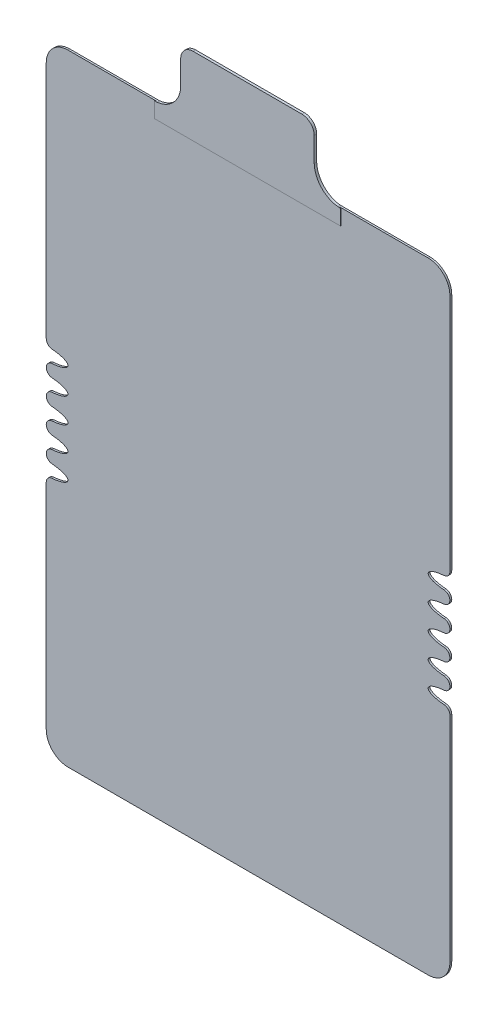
ISO-10303-21;
HEADER;
FILE_DESCRIPTION(('STEP AP214'),'2;1');
FILE_NAME('part.step','',(''),(''),'','','');
FILE_SCHEMA(('AUTOMOTIVE_DESIGN { 1 0 10303 214 1 1 1 1 }'));
ENDSEC;
DATA;
#1=APPLICATION_CONTEXT('core data for automotive mechanical design processes');
#2=APPLICATION_PROTOCOL_DEFINITION('international standard','automotive_design',2000,#1);
#3=PRODUCT_CONTEXT('',#1,'mechanical');
#4=PRODUCT('Part','Part','',(#3));
#5=PRODUCT_RELATED_PRODUCT_CATEGORY('part','',(#4));
#6=PRODUCT_DEFINITION_FORMATION('','',#4);
#7=PRODUCT_DEFINITION_CONTEXT('part definition',#1,'design');
#8=PRODUCT_DEFINITION('design','',#6,#7);
#9=PRODUCT_DEFINITION_SHAPE('','',#8);
#10=(LENGTH_UNIT() NAMED_UNIT(*) SI_UNIT(.MILLI.,.METRE.));
#11=(NAMED_UNIT(*) PLANE_ANGLE_UNIT() SI_UNIT($,.RADIAN.));
#12=(NAMED_UNIT(*) SI_UNIT($,.STERADIAN.) SOLID_ANGLE_UNIT());
#13=UNCERTAINTY_MEASURE_WITH_UNIT(LENGTH_MEASURE(1.E-05),#10,'distance_accuracy_value','');
#14=(GEOMETRIC_REPRESENTATION_CONTEXT(3) GLOBAL_UNCERTAINTY_ASSIGNED_CONTEXT((#13)) GLOBAL_UNIT_ASSIGNED_CONTEXT((#10,
#11,#12)) REPRESENTATION_CONTEXT('',''));
#15=CARTESIAN_POINT('',(0.,0.,0.));
#16=DIRECTION('',(0.,0.,1.));
#17=DIRECTION('',(1.,0.,0.));
#18=AXIS2_PLACEMENT_3D('',#15,#16,#17);
#19=CARTESIAN_POINT('',(-63.,4.01464371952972,0.6));
#20=DIRECTION('',(0.,0.,-1.));
#21=DIRECTION('',(-1.,0.,0.));
#22=AXIS2_PLACEMENT_3D('',#19,#20,#21);
#23=CYLINDRICAL_SURFACE('',#22,2.);
#24=CARTESIAN_POINT('',(-63.,4.01464371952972,0.));
#25=DIRECTION('',(0.,0.,1.));
#26=DIRECTION('',(1.,0.,0.));
#27=AXIS2_PLACEMENT_3D('',#24,#25,#26);
#28=CIRCLE('',#27,2.);
#29=CARTESIAN_POINT('',(-63.1622955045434,2.02123955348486,0.));
#30=VERTEX_POINT('',#29);
#31=CARTESIAN_POINT('',(-64.999946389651,3.99999999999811,0.));
#32=VERTEX_POINT('',#31);
#33=EDGE_CURVE('E599',#30,#32,#28,.F.);
#34=ORIENTED_EDGE('',*,*,#33,.F.);
#35=DIRECTION('',(0.,0.,-1.));
#36=VECTOR('',#35,1.);
#37=CARTESIAN_POINT('',(-63.1622955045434,2.02123955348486,0.6));
#38=LINE('',#37,#36);
#39=CARTESIAN_POINT('',(-63.1622955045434,2.02123955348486,0.6));
#40=VERTEX_POINT('',#39);
#41=EDGE_CURVE('E11',#40,#30,#38,.T.);
#42=ORIENTED_EDGE('',*,*,#41,.F.);
#43=CARTESIAN_POINT('',(-63.,4.01464371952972,0.6));
#44=DIRECTION('',(0.,0.,1.));
#45=DIRECTION('',(1.,0.,0.));
#46=AXIS2_PLACEMENT_3D('',#43,#44,#45);
#47=CIRCLE('',#46,2.);
#48=CARTESIAN_POINT('',(-64.999946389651,3.99999999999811,0.6));
#49=VERTEX_POINT('',#48);
#50=EDGE_CURVE('E726',#40,#49,#47,.F.);
#51=ORIENTED_EDGE('',*,*,#50,.T.);
#52=DIRECTION('',(0.,0.,-1.));
#53=VECTOR('',#52,1.);
#54=CARTESIAN_POINT('',(-64.999946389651,3.99999999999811,0.6));
#55=LINE('',#54,#53);
#56=EDGE_CURVE('E189',#49,#32,#55,.T.);
#57=ORIENTED_EDGE('',*,*,#56,.T.);
#58=EDGE_LOOP('',(#34,#42,#51,#57));
#59=FACE_BOUND('',#58,.T.);
#60=ADVANCED_FACE('F41',(#59),#23,.T.);
#61=CARTESIAN_POINT('',(-64.9999999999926,-3.85912223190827E-13,0.6));
#62=DIRECTION('',(0.,0.,-1.));
#63=DIRECTION('',(1.,0.,0.));
#64=AXIS2_PLACEMENT_3D('',#61,#62,#63);
#65=ELLIPSE('',#64,6.99996368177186,2.09471443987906);
#66=DIRECTION('',(0.,0.,-1.));
#67=VECTOR('',#66,1.);
#68=SURFACE_OF_LINEAR_EXTRUSION('',#65,#67);
#69=CARTESIAN_POINT('',(-64.9999999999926,-3.85912223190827E-13,0.));
#70=DIRECTION('',(0.,0.,-1.));
#71=DIRECTION('',(1.,0.,0.));
#72=AXIS2_PLACEMENT_3D('',#69,#70,#71);
#73=ELLIPSE('',#72,6.99996368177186,2.09471443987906);
#74=CARTESIAN_POINT('',(-63.1622955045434,-2.02123955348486,0.));
#75=VERTEX_POINT('',#74);
#76=EDGE_CURVE('E589',#30,#75,#73,.T.);
#77=ORIENTED_EDGE('',*,*,#76,.T.);
#78=DIRECTION('',(0.,0.,-1.));
#79=VECTOR('',#78,1.);
#80=CARTESIAN_POINT('',(-63.1622955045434,-2.02123955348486,0.6));
#81=LINE('',#80,#79);
#82=CARTESIAN_POINT('',(-63.1622955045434,-2.02123955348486,0.6));
#83=VERTEX_POINT('',#82);
#84=EDGE_CURVE('E50',#83,#75,#81,.T.);
#85=ORIENTED_EDGE('',*,*,#84,.F.);
#86=EDGE_CURVE('E773',#40,#83,#65,.T.);
#87=ORIENTED_EDGE('',*,*,#86,.F.);
#88=ORIENTED_EDGE('',*,*,#41,.T.);
#89=EDGE_LOOP('',(#77,#85,#87,#88));
#90=FACE_BOUND('',#89,.T.);
#91=ADVANCED_FACE('F865',(#90),#68,.F.);
#92=CARTESIAN_POINT('',(-63.,-4.01464371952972,0.6));
#93=DIRECTION('',(0.,0.,-1.));
#94=DIRECTION('',(-1.,0.,0.));
#95=AXIS2_PLACEMENT_3D('',#92,#93,#94);
#96=CYLINDRICAL_SURFACE('',#95,2.);
#97=CARTESIAN_POINT('',(-63.,-4.01464371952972,0.));
#98=DIRECTION('',(0.,0.,1.));
#99=DIRECTION('',(1.,0.,0.));
#100=AXIS2_PLACEMENT_3D('',#97,#98,#99);
#101=CIRCLE('',#100,2.);
#102=CARTESIAN_POINT('',(-64.9999463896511,-4.00000000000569,0.));
#103=VERTEX_POINT('',#102);
#104=EDGE_CURVE('E580',#75,#103,#101,.T.);
#105=ORIENTED_EDGE('',*,*,#104,.T.);
#106=DIRECTION('',(0.,0.,-1.));
#107=VECTOR('',#106,1.);
#108=CARTESIAN_POINT('',(-64.9999463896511,-4.00000000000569,0.6));
#109=LINE('',#108,#107);
#110=CARTESIAN_POINT('',(-64.9999463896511,-4.00000000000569,0.6));
#111=VERTEX_POINT('',#110);
#112=EDGE_CURVE('E569',#111,#103,#109,.T.);
#113=ORIENTED_EDGE('',*,*,#112,.F.);
#114=CARTESIAN_POINT('',(-63.,-4.01464371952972,0.6));
#115=DIRECTION('',(0.,0.,1.));
#116=DIRECTION('',(1.,0.,0.));
#117=AXIS2_PLACEMENT_3D('',#114,#115,#116);
#118=CIRCLE('',#117,2.);
#119=EDGE_CURVE('E582',#83,#111,#118,.T.);
#120=ORIENTED_EDGE('',*,*,#119,.F.);
#121=ORIENTED_EDGE('',*,*,#84,.T.);
#122=EDGE_LOOP('',(#105,#113,#120,#121));
#123=FACE_BOUND('',#122,.T.);
#124=ADVANCED_FACE('F578',(#123),#96,.T.);
#125=CARTESIAN_POINT('',(-63.0000000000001,-3.98535628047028,0.6));
#126=DIRECTION('',(0.,0.,-1.));
#127=DIRECTION('',(-1.,0.,0.));
#128=AXIS2_PLACEMENT_3D('',#125,#126,#127);
#129=CYLINDRICAL_SURFACE('',#128,2.);
#130=CARTESIAN_POINT('',(-63.0000000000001,-3.98535628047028,0.));
#131=DIRECTION('',(0.,0.,1.));
#132=DIRECTION('',(1.,0.,0.));
#133=AXIS2_PLACEMENT_3D('',#130,#131,#132);
#134=CIRCLE('',#133,2.);
#135=CARTESIAN_POINT('',(-63.1622955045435,-5.97876044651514,0.));
#136=VERTEX_POINT('',#135);
#137=EDGE_CURVE('E592',#136,#103,#134,.F.);
#138=ORIENTED_EDGE('',*,*,#137,.F.);
#139=DIRECTION('',(0.,0.,-1.));
#140=VECTOR('',#139,1.);
#141=CARTESIAN_POINT('',(-63.1622955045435,-5.97876044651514,0.6));
#142=LINE('',#141,#140);
#143=CARTESIAN_POINT('',(-63.1622955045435,-5.97876044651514,0.6));
#144=VERTEX_POINT('',#143);
#145=EDGE_CURVE('E566',#144,#136,#142,.T.);
#146=ORIENTED_EDGE('',*,*,#145,.F.);
#147=CARTESIAN_POINT('',(-63.0000000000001,-3.98535628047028,0.6));
#148=DIRECTION('',(0.,0.,1.));
#149=DIRECTION('',(1.,0.,0.));
#150=AXIS2_PLACEMENT_3D('',#147,#148,#149);
#151=CIRCLE('',#150,2.);
#152=EDGE_CURVE('E778',#144,#111,#151,.F.);
#153=ORIENTED_EDGE('',*,*,#152,.T.);
#154=ORIENTED_EDGE('',*,*,#112,.T.);
#155=EDGE_LOOP('',(#138,#146,#153,#154));
#156=FACE_BOUND('',#155,.T.);
#157=ADVANCED_FACE('F891',(#156),#129,.T.);
#158=CARTESIAN_POINT('',(-64.9999999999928,-8.00000000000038,0.6));
#159=DIRECTION('',(0.,0.,-1.));
#160=DIRECTION('',(1.,0.,0.));
#161=AXIS2_PLACEMENT_3D('',#158,#159,#160);
#162=ELLIPSE('',#161,6.99997009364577,2.09471429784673);
#163=DIRECTION('',(0.,0.,-1.));
#164=VECTOR('',#163,1.);
#165=SURFACE_OF_LINEAR_EXTRUSION('',#162,#164);
#166=CARTESIAN_POINT('',(-64.9999999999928,-8.00000000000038,0.));
#167=DIRECTION('',(0.,0.,-1.));
#168=DIRECTION('',(1.,0.,0.));
#169=AXIS2_PLACEMENT_3D('',#166,#167,#168);
#170=ELLIPSE('',#169,6.99997009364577,2.09471429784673);
#171=CARTESIAN_POINT('',(-63.1622955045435,-10.0212395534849,0.));
#172=VERTEX_POINT('',#171);
#173=EDGE_CURVE('E597',#136,#172,#170,.T.);
#174=ORIENTED_EDGE('',*,*,#173,.T.);
#175=DIRECTION('',(0.,0.,-1.));
#176=VECTOR('',#175,1.);
#177=CARTESIAN_POINT('',(-63.1622955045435,-10.0212395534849,0.6));
#178=LINE('',#177,#176);
#179=CARTESIAN_POINT('',(-63.1622955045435,-10.0212395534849,0.6));
#180=VERTEX_POINT('',#179);
#181=EDGE_CURVE('E562',#180,#172,#178,.T.);
#182=ORIENTED_EDGE('',*,*,#181,.F.);
#183=EDGE_CURVE('E782',#144,#180,#162,.T.);
#184=ORIENTED_EDGE('',*,*,#183,.F.);
#185=ORIENTED_EDGE('',*,*,#145,.T.);
#186=EDGE_LOOP('',(#174,#182,#184,#185));
#187=FACE_BOUND('',#186,.T.);
#188=ADVANCED_FACE('F894',(#187),#165,.F.);
#189=CARTESIAN_POINT('',(-63.0000000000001,-12.0146437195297,0.6));
#190=DIRECTION('',(0.,0.,-1.));
#191=DIRECTION('',(-1.,0.,0.));
#192=AXIS2_PLACEMENT_3D('',#189,#190,#191);
#193=CYLINDRICAL_SURFACE('',#192,2.);
#194=CARTESIAN_POINT('',(-63.0000000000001,-12.0146437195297,0.));
#195=DIRECTION('',(0.,0.,1.));
#196=DIRECTION('',(1.,0.,0.));
#197=AXIS2_PLACEMENT_3D('',#194,#195,#196);
#198=CIRCLE('',#197,2.);
#199=CARTESIAN_POINT('',(-64.9999463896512,-12.0000000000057,0.));
#200=VERTEX_POINT('',#199);
#201=EDGE_CURVE('E604',#172,#200,#198,.T.);
#202=ORIENTED_EDGE('',*,*,#201,.T.);
#203=DIRECTION('',(0.,0.,-1.));
#204=VECTOR('',#203,1.);
#205=CARTESIAN_POINT('',(-64.9999463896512,-12.0000000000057,0.6));
#206=LINE('',#205,#204);
#207=CARTESIAN_POINT('',(-64.9999463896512,-12.0000000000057,0.6));
#208=VERTEX_POINT('',#207);
#209=EDGE_CURVE('E559',#208,#200,#206,.T.);
#210=ORIENTED_EDGE('',*,*,#209,.F.);
#211=CARTESIAN_POINT('',(-63.0000000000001,-12.0146437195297,0.6));
#212=DIRECTION('',(0.,0.,1.));
#213=DIRECTION('',(1.,0.,0.));
#214=AXIS2_PLACEMENT_3D('',#211,#212,#213);
#215=CIRCLE('',#214,2.);
#216=EDGE_CURVE('E785',#180,#208,#215,.T.);
#217=ORIENTED_EDGE('',*,*,#216,.F.);
#218=ORIENTED_EDGE('',*,*,#181,.T.);
#219=EDGE_LOOP('',(#202,#210,#217,#218));
#220=FACE_BOUND('',#219,.T.);
#221=ADVANCED_FACE('F898',(#220),#193,.T.);
#222=CARTESIAN_POINT('',(-63.0000000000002,-11.9853562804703,0.6));
#223=DIRECTION('',(0.,0.,-1.));
#224=DIRECTION('',(-1.,0.,0.));
#225=AXIS2_PLACEMENT_3D('',#222,#223,#224);
#226=CYLINDRICAL_SURFACE('',#225,2.);
#227=CARTESIAN_POINT('',(-63.0000000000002,-11.9853562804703,0.));
#228=DIRECTION('',(0.,0.,1.));
#229=DIRECTION('',(1.,0.,0.));
#230=AXIS2_PLACEMENT_3D('',#227,#228,#229);
#231=CIRCLE('',#230,2.);
#232=CARTESIAN_POINT('',(-63.1622955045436,-13.9787604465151,0.));
#233=VERTEX_POINT('',#232);
#234=EDGE_CURVE('E608',#233,#200,#231,.F.);
#235=ORIENTED_EDGE('',*,*,#234,.F.);
#236=DIRECTION('',(0.,0.,-1.));
#237=VECTOR('',#236,1.);
#238=CARTESIAN_POINT('',(-63.1622955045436,-13.9787604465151,0.6));
#239=LINE('',#238,#237);
#240=CARTESIAN_POINT('',(-63.1622955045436,-13.9787604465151,0.6));
#241=VERTEX_POINT('',#240);
#242=EDGE_CURVE('E556',#241,#233,#239,.T.);
#243=ORIENTED_EDGE('',*,*,#242,.F.);
#244=CARTESIAN_POINT('',(-63.0000000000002,-11.9853562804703,0.6));
#245=DIRECTION('',(0.,0.,1.));
#246=DIRECTION('',(1.,0.,0.));
#247=AXIS2_PLACEMENT_3D('',#244,#245,#246);
#248=CIRCLE('',#247,2.);
#249=EDGE_CURVE('E788',#241,#208,#248,.F.);
#250=ORIENTED_EDGE('',*,*,#249,.T.);
#251=ORIENTED_EDGE('',*,*,#209,.T.);
#252=EDGE_LOOP('',(#235,#243,#250,#251));
#253=FACE_BOUND('',#252,.T.);
#254=ADVANCED_FACE('F908',(#253),#226,.T.);
#255=CARTESIAN_POINT('',(-64.9999999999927,-16.0000000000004,0.6));
#256=DIRECTION('',(0.,0.,-1.));
#257=DIRECTION('',(1.,0.,0.));
#258=AXIS2_PLACEMENT_3D('',#255,#256,#257);
#259=ELLIPSE('',#258,6.99996064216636,2.09471450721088);
#260=DIRECTION('',(0.,0.,-1.));
#261=VECTOR('',#260,1.);
#262=SURFACE_OF_LINEAR_EXTRUSION('',#259,#261);
#263=CARTESIAN_POINT('',(-64.9999999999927,-16.0000000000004,0.));
#264=DIRECTION('',(0.,0.,-1.));
#265=DIRECTION('',(1.,0.,0.));
#266=AXIS2_PLACEMENT_3D('',#263,#264,#265);
#267=ELLIPSE('',#266,6.99996064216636,2.09471450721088);
#268=CARTESIAN_POINT('',(-63.1622955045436,-18.0212395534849,0.));
#269=VERTEX_POINT('',#268);
#270=EDGE_CURVE('E612',#233,#269,#267,.T.);
#271=ORIENTED_EDGE('',*,*,#270,.T.);
#272=DIRECTION('',(0.,0.,-1.));
#273=VECTOR('',#272,1.);
#274=CARTESIAN_POINT('',(-63.1622955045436,-18.0212395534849,0.6));
#275=LINE('',#274,#273);
#276=CARTESIAN_POINT('',(-63.1622955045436,-18.0212395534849,0.6));
#277=VERTEX_POINT('',#276);
#278=EDGE_CURVE('E552',#277,#269,#275,.T.);
#279=ORIENTED_EDGE('',*,*,#278,.F.);
#280=EDGE_CURVE('E792',#241,#277,#259,.T.);
#281=ORIENTED_EDGE('',*,*,#280,.F.);
#282=ORIENTED_EDGE('',*,*,#242,.T.);
#283=EDGE_LOOP('',(#271,#279,#281,#282));
#284=FACE_BOUND('',#283,.T.);
#285=ADVANCED_FACE('F904',(#284),#262,.F.);
#286=CARTESIAN_POINT('',(-63.0000000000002,-20.0146437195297,0.6));
#287=DIRECTION('',(0.,0.,-1.));
#288=DIRECTION('',(-1.,0.,0.));
#289=AXIS2_PLACEMENT_3D('',#286,#287,#288);
#290=CYLINDRICAL_SURFACE('',#289,2.);
#291=CARTESIAN_POINT('',(-63.0000000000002,-20.0146437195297,0.));
#292=DIRECTION('',(0.,0.,1.));
#293=DIRECTION('',(1.,0.,0.));
#294=AXIS2_PLACEMENT_3D('',#291,#292,#293);
#295=CIRCLE('',#294,2.);
#296=CARTESIAN_POINT('',(-65.0000000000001,-20.0146437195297,0.));
#297=VERTEX_POINT('',#296);
#298=EDGE_CURVE('E615',#269,#297,#295,.T.);
#299=ORIENTED_EDGE('',*,*,#298,.T.);
#300=DIRECTION('',(0.,0.,-1.));
#301=VECTOR('',#300,1.);
#302=CARTESIAN_POINT('',(-65.0000000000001,-20.0146437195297,0.6));
#303=LINE('',#302,#301);
#304=CARTESIAN_POINT('',(-65.0000000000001,-20.0146437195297,0.6));
#305=VERTEX_POINT('',#304);
#306=EDGE_CURVE('E548',#305,#297,#303,.T.);
#307=ORIENTED_EDGE('',*,*,#306,.F.);
#308=CARTESIAN_POINT('',(-63.0000000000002,-20.0146437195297,0.6));
#309=DIRECTION('',(0.,0.,1.));
#310=DIRECTION('',(1.,0.,0.));
#311=AXIS2_PLACEMENT_3D('',#308,#309,#310);
#312=CIRCLE('',#311,2.);
#313=EDGE_CURVE('E795',#277,#305,#312,.T.);
#314=ORIENTED_EDGE('',*,*,#313,.F.);
#315=ORIENTED_EDGE('',*,*,#278,.T.);
#316=EDGE_LOOP('',(#299,#307,#314,#315));
#317=FACE_BOUND('',#316,.T.);
#318=ADVANCED_FACE('F907',(#317),#290,.T.);
#319=CARTESIAN_POINT('',(-65.0000000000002,-1.63979034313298E-13,0.6));
#320=DIRECTION('',(1.,0.,0.));
#321=DIRECTION('',(0.,1.,0.));
#322=AXIS2_PLACEMENT_3D('',#319,#320,#321);
#323=PLANE('',#322);
#324=DIRECTION('',(0.,-1.,0.));
#325=VECTOR('',#324,1.);
#326=CARTESIAN_POINT('',(-65.0000000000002,-1.63979034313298E-13,0.));
#327=LINE('',#326,#325);
#328=CARTESIAN_POINT('',(-65.,-89.,0.));
#329=VERTEX_POINT('',#328);
#330=EDGE_CURVE('E618',#297,#329,#327,.T.);
#331=ORIENTED_EDGE('',*,*,#330,.T.);
#332=DIRECTION('',(0.,0.,-1.));
#333=VECTOR('',#332,1.);
#334=CARTESIAN_POINT('',(-65.,-89.,0.6));
#335=LINE('',#334,#333);
#336=CARTESIAN_POINT('',(-65.,-89.,0.6));
#337=VERTEX_POINT('',#336);
#338=EDGE_CURVE('E544',#337,#329,#335,.T.);
#339=ORIENTED_EDGE('',*,*,#338,.F.);
#340=DIRECTION('',(0.,-1.,0.));
#341=VECTOR('',#340,1.);
#342=CARTESIAN_POINT('',(-65.0000000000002,-1.63979034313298E-13,0.6));
#343=LINE('',#342,#341);
#344=EDGE_CURVE('E798',#305,#337,#343,.T.);
#345=ORIENTED_EDGE('',*,*,#344,.F.);
#346=ORIENTED_EDGE('',*,*,#306,.T.);
#347=EDGE_LOOP('',(#331,#339,#345,#346));
#348=FACE_BOUND('',#347,.T.);
#349=ADVANCED_FACE('F938',(#348),#323,.F.);
#350=CARTESIAN_POINT('',(-58.,-89.,0.6));
#351=DIRECTION('',(0.,0.,-1.));
#352=DIRECTION('',(-1.,0.,0.));
#353=AXIS2_PLACEMENT_3D('',#350,#351,#352);
#354=CYLINDRICAL_SURFACE('',#353,7.00000000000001);
#355=CARTESIAN_POINT('',(-58.,-89.,0.));
#356=DIRECTION('',(0.,0.,1.));
#357=DIRECTION('',(1.,0.,0.));
#358=AXIS2_PLACEMENT_3D('',#355,#356,#357);
#359=CIRCLE('',#358,7.00000000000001);
#360=CARTESIAN_POINT('',(-58.,-96.,0.));
#361=VERTEX_POINT('',#360);
#362=EDGE_CURVE('E621',#329,#361,#359,.T.);
#363=ORIENTED_EDGE('',*,*,#362,.T.);
#364=DIRECTION('',(0.,0.,-1.));
#365=VECTOR('',#364,1.);
#366=CARTESIAN_POINT('',(-58.,-96.,0.6));
#367=LINE('',#366,#365);
#368=CARTESIAN_POINT('',(-58.,-96.,0.6));
#369=VERTEX_POINT('',#368);
#370=EDGE_CURVE('E540',#369,#361,#367,.T.);
#371=ORIENTED_EDGE('',*,*,#370,.F.);
#372=CARTESIAN_POINT('',(-58.,-89.,0.6));
#373=DIRECTION('',(0.,0.,1.));
#374=DIRECTION('',(1.,0.,0.));
#375=AXIS2_PLACEMENT_3D('',#372,#373,#374);
#376=CIRCLE('',#375,7.00000000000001);
#377=EDGE_CURVE('E801',#337,#369,#376,.T.);
#378=ORIENTED_EDGE('',*,*,#377,.F.);
#379=ORIENTED_EDGE('',*,*,#338,.T.);
#380=EDGE_LOOP('',(#363,#371,#378,#379));
#381=FACE_BOUND('',#380,.T.);
#382=ADVANCED_FACE('F941',(#381),#354,.T.);
#383=CARTESIAN_POINT('',(0.,-96.,0.6));
#384=DIRECTION('',(0.,1.,0.));
#385=DIRECTION('',(-1.,0.,0.));
#386=AXIS2_PLACEMENT_3D('',#383,#384,#385);
#387=PLANE('',#386);
#388=DIRECTION('',(1.,0.,0.));
#389=VECTOR('',#388,1.);
#390=CARTESIAN_POINT('',(0.,-96.,0.));
#391=LINE('',#390,#389);
#392=CARTESIAN_POINT('',(58.,-96.,0.));
#393=VERTEX_POINT('',#392);
#394=EDGE_CURVE('E624',#361,#393,#391,.T.);
#395=ORIENTED_EDGE('',*,*,#394,.T.);
#396=DIRECTION('',(0.,0.,-1.));
#397=VECTOR('',#396,1.);
#398=CARTESIAN_POINT('',(58.,-96.,0.6));
#399=LINE('',#398,#397);
#400=CARTESIAN_POINT('',(58.,-96.,0.6));
#401=VERTEX_POINT('',#400);
#402=EDGE_CURVE('E536',#401,#393,#399,.T.);
#403=ORIENTED_EDGE('',*,*,#402,.F.);
#404=DIRECTION('',(1.,0.,0.));
#405=VECTOR('',#404,1.);
#406=CARTESIAN_POINT('',(0.,-96.,0.6));
#407=LINE('',#406,#405);
#408=EDGE_CURVE('E804',#369,#401,#407,.T.);
#409=ORIENTED_EDGE('',*,*,#408,.F.);
#410=ORIENTED_EDGE('',*,*,#370,.T.);
#411=EDGE_LOOP('',(#395,#403,#409,#410));
#412=FACE_BOUND('',#411,.T.);
#413=ADVANCED_FACE('F946',(#412),#387,.F.);
#414=CARTESIAN_POINT('',(58.,-89.,0.6));
#415=DIRECTION('',(0.,0.,-1.));
#416=DIRECTION('',(-1.,0.,0.));
#417=AXIS2_PLACEMENT_3D('',#414,#415,#416);
#418=CYLINDRICAL_SURFACE('',#417,7.);
#419=CARTESIAN_POINT('',(58.,-89.,0.));
#420=DIRECTION('',(0.,0.,1.));
#421=DIRECTION('',(1.,0.,0.));
#422=AXIS2_PLACEMENT_3D('',#419,#420,#421);
#423=CIRCLE('',#422,7.);
#424=CARTESIAN_POINT('',(65.,-89.,0.));
#425=VERTEX_POINT('',#424);
#426=EDGE_CURVE('E627',#393,#425,#423,.T.);
#427=ORIENTED_EDGE('',*,*,#426,.T.);
#428=DIRECTION('',(0.,0.,-1.));
#429=VECTOR('',#428,1.);
#430=CARTESIAN_POINT('',(65.,-89.,0.6));
#431=LINE('',#430,#429);
#432=CARTESIAN_POINT('',(65.,-89.,0.6));
#433=VERTEX_POINT('',#432);
#434=EDGE_CURVE('E533',#433,#425,#431,.T.);
#435=ORIENTED_EDGE('',*,*,#434,.F.);
#436=CARTESIAN_POINT('',(58.,-89.,0.6));
#437=DIRECTION('',(0.,0.,1.));
#438=DIRECTION('',(1.,0.,0.));
#439=AXIS2_PLACEMENT_3D('',#436,#437,#438);
#440=CIRCLE('',#439,7.);
#441=EDGE_CURVE('E807',#401,#433,#440,.T.);
#442=ORIENTED_EDGE('',*,*,#441,.F.);
#443=ORIENTED_EDGE('',*,*,#402,.T.);
#444=EDGE_LOOP('',(#427,#435,#442,#443));
#445=FACE_BOUND('',#444,.T.);
#446=ADVANCED_FACE('F952',(#445),#418,.T.);
#447=CARTESIAN_POINT('',(65.0000000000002,-1.5691264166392E-13,0.6));
#448=DIRECTION('',(1.,0.,0.));
#449=DIRECTION('',(0.,1.,0.));
#450=AXIS2_PLACEMENT_3D('',#447,#448,#449);
#451=PLANE('',#450);
#452=DIRECTION('',(0.,-1.,0.));
#453=VECTOR('',#452,1.);
#454=CARTESIAN_POINT('',(65.0000000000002,-1.5691264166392E-13,0.));
#455=LINE('',#454,#453);
#456=CARTESIAN_POINT('',(65.0000000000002,-20.0146437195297,0.));
#457=VERTEX_POINT('',#456);
#458=EDGE_CURVE('E631',#457,#425,#455,.T.);
#459=ORIENTED_EDGE('',*,*,#458,.F.);
#460=DIRECTION('',(0.,0.,-1.));
#461=VECTOR('',#460,1.);
#462=CARTESIAN_POINT('',(65.0000000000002,-20.0146437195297,0.6));
#463=LINE('',#462,#461);
#464=CARTESIAN_POINT('',(65.0000000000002,-20.0146437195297,0.6));
#465=VERTEX_POINT('',#464);
#466=EDGE_CURVE('E530',#465,#457,#463,.T.);
#467=ORIENTED_EDGE('',*,*,#466,.F.);
#468=DIRECTION('',(0.,-1.,0.));
#469=VECTOR('',#468,1.);
#470=CARTESIAN_POINT('',(65.0000000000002,-1.5691264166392E-13,0.6));
#471=LINE('',#470,#469);
#472=EDGE_CURVE('E810',#465,#433,#471,.T.);
#473=ORIENTED_EDGE('',*,*,#472,.T.);
#474=ORIENTED_EDGE('',*,*,#434,.T.);
#475=EDGE_LOOP('',(#459,#467,#473,#474));
#476=FACE_BOUND('',#475,.T.);
#477=ADVANCED_FACE('F956',(#476),#451,.T.);
#478=CARTESIAN_POINT('',(63.0000000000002,-20.0146437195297,0.6));
#479=DIRECTION('',(0.,0.,-1.));
#480=DIRECTION('',(-1.,0.,0.));
#481=AXIS2_PLACEMENT_3D('',#478,#479,#480);
#482=CYLINDRICAL_SURFACE('',#481,2.);
#483=CARTESIAN_POINT('',(63.0000000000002,-20.0146437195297,0.));
#484=DIRECTION('',(0.,0.,1.));
#485=DIRECTION('',(1.,0.,0.));
#486=AXIS2_PLACEMENT_3D('',#483,#484,#485);
#487=CIRCLE('',#486,2.);
#488=CARTESIAN_POINT('',(63.1622955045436,-18.0212395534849,0.));
#489=VERTEX_POINT('',#488);
#490=EDGE_CURVE('E635',#489,#457,#487,.F.);
#491=ORIENTED_EDGE('',*,*,#490,.F.);
#492=DIRECTION('',(0.,0.,-1.));
#493=VECTOR('',#492,1.);
#494=CARTESIAN_POINT('',(63.1622955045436,-18.0212395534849,0.6));
#495=LINE('',#494,#493);
#496=CARTESIAN_POINT('',(63.1622955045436,-18.0212395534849,0.6));
#497=VERTEX_POINT('',#496);
#498=EDGE_CURVE('E527',#497,#489,#495,.T.);
#499=ORIENTED_EDGE('',*,*,#498,.F.);
#500=CARTESIAN_POINT('',(63.0000000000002,-20.0146437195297,0.6));
#501=DIRECTION('',(0.,0.,1.));
#502=DIRECTION('',(1.,0.,0.));
#503=AXIS2_PLACEMENT_3D('',#500,#501,#502);
#504=CIRCLE('',#503,2.);
#505=EDGE_CURVE('E814',#497,#465,#504,.F.);
#506=ORIENTED_EDGE('',*,*,#505,.T.);
#507=ORIENTED_EDGE('',*,*,#466,.T.);
#508=EDGE_LOOP('',(#491,#499,#506,#507));
#509=FACE_BOUND('',#508,.T.);
#510=ADVANCED_FACE('F959',(#509),#482,.T.);
#511=CARTESIAN_POINT('',(64.9999999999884,-16.0000000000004,0.6));
#512=DIRECTION('',(0.,0.,1.));
#513=DIRECTION('',(-1.,0.,0.));
#514=AXIS2_PLACEMENT_3D('',#511,#512,#513);
#515=ELLIPSE('',#514,6.99997158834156,2.09471426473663);
#516=DIRECTION('',(0.,0.,-1.));
#517=VECTOR('',#516,1.);
#518=SURFACE_OF_LINEAR_EXTRUSION('',#515,#517);
#519=CARTESIAN_POINT('',(64.9999999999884,-16.0000000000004,0.));
#520=DIRECTION('',(0.,0.,1.));
#521=DIRECTION('',(-1.,0.,0.));
#522=AXIS2_PLACEMENT_3D('',#519,#520,#521);
#523=ELLIPSE('',#522,6.99997158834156,2.09471426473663);
#524=CARTESIAN_POINT('',(63.1622955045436,-13.9787604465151,0.));
#525=VERTEX_POINT('',#524);
#526=EDGE_CURVE('E639',#525,#489,#523,.T.);
#527=ORIENTED_EDGE('',*,*,#526,.F.);
#528=DIRECTION('',(0.,0.,-1.));
#529=VECTOR('',#528,1.);
#530=CARTESIAN_POINT('',(63.1622955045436,-13.9787604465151,0.6));
#531=LINE('',#530,#529);
#532=CARTESIAN_POINT('',(63.1622955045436,-13.9787604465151,0.6));
#533=VERTEX_POINT('',#532);
#534=EDGE_CURVE('E524',#533,#525,#531,.T.);
#535=ORIENTED_EDGE('',*,*,#534,.F.);
#536=EDGE_CURVE('E818',#533,#497,#515,.T.);
#537=ORIENTED_EDGE('',*,*,#536,.T.);
#538=ORIENTED_EDGE('',*,*,#498,.T.);
#539=EDGE_LOOP('',(#527,#535,#537,#538));
#540=FACE_BOUND('',#539,.T.);
#541=ADVANCED_FACE('F963',(#540),#518,.T.);
#542=CARTESIAN_POINT('',(63.0000000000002,-11.9853562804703,0.6));
#543=DIRECTION('',(0.,0.,-1.));
#544=DIRECTION('',(-1.,0.,0.));
#545=AXIS2_PLACEMENT_3D('',#542,#543,#544);
#546=CYLINDRICAL_SURFACE('',#545,2.);
#547=CARTESIAN_POINT('',(63.0000000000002,-11.9853562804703,0.));
#548=DIRECTION('',(0.,0.,1.));
#549=DIRECTION('',(1.,0.,0.));
#550=AXIS2_PLACEMENT_3D('',#547,#548,#549);
#551=CIRCLE('',#550,2.);
#552=CARTESIAN_POINT('',(64.9999463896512,-12.0000000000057,0.));
#553=VERTEX_POINT('',#552);
#554=EDGE_CURVE('E643',#525,#553,#551,.T.);
#555=ORIENTED_EDGE('',*,*,#554,.T.);
#556=DIRECTION('',(0.,0.,-1.));
#557=VECTOR('',#556,1.);
#558=CARTESIAN_POINT('',(64.9999463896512,-12.0000000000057,0.6));
#559=LINE('',#558,#557);
#560=CARTESIAN_POINT('',(64.9999463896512,-12.0000000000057,0.6));
#561=VERTEX_POINT('',#560);
#562=EDGE_CURVE('E521',#561,#553,#559,.T.);
#563=ORIENTED_EDGE('',*,*,#562,.F.);
#564=CARTESIAN_POINT('',(63.0000000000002,-11.9853562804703,0.6));
#565=DIRECTION('',(0.,0.,1.));
#566=DIRECTION('',(1.,0.,0.));
#567=AXIS2_PLACEMENT_3D('',#564,#565,#566);
#568=CIRCLE('',#567,2.);
#569=EDGE_CURVE('E822',#533,#561,#568,.T.);
#570=ORIENTED_EDGE('',*,*,#569,.F.);
#571=ORIENTED_EDGE('',*,*,#534,.T.);
#572=EDGE_LOOP('',(#555,#563,#570,#571));
#573=FACE_BOUND('',#572,.T.);
#574=ADVANCED_FACE('F968',(#573),#546,.T.);
#575=CARTESIAN_POINT('',(63.0000000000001,-12.0146437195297,0.6));
#576=DIRECTION('',(0.,0.,-1.));
#577=DIRECTION('',(-1.,0.,0.));
#578=AXIS2_PLACEMENT_3D('',#575,#576,#577);
#579=CYLINDRICAL_SURFACE('',#578,2.);
#580=CARTESIAN_POINT('',(63.0000000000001,-12.0146437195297,0.));
#581=DIRECTION('',(0.,0.,1.));
#582=DIRECTION('',(1.,0.,0.));
#583=AXIS2_PLACEMENT_3D('',#580,#581,#582);
#584=CIRCLE('',#583,2.);
#585=CARTESIAN_POINT('',(63.1622955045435,-10.0212395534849,0.));
#586=VERTEX_POINT('',#585);
#587=EDGE_CURVE('E647',#586,#553,#584,.F.);
#588=ORIENTED_EDGE('',*,*,#587,.F.);
#589=DIRECTION('',(0.,0.,-1.));
#590=VECTOR('',#589,1.);
#591=CARTESIAN_POINT('',(63.1622955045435,-10.0212395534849,0.6));
#592=LINE('',#591,#590);
#593=CARTESIAN_POINT('',(63.1622955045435,-10.0212395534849,0.6));
#594=VERTEX_POINT('',#593);
#595=EDGE_CURVE('E518',#594,#586,#592,.T.);
#596=ORIENTED_EDGE('',*,*,#595,.F.);
#597=CARTESIAN_POINT('',(63.0000000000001,-12.0146437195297,0.6));
#598=DIRECTION('',(0.,0.,1.));
#599=DIRECTION('',(1.,0.,0.));
#600=AXIS2_PLACEMENT_3D('',#597,#598,#599);
#601=CIRCLE('',#600,2.);
#602=EDGE_CURVE('E825',#594,#561,#601,.F.);
#603=ORIENTED_EDGE('',*,*,#602,.T.);
#604=ORIENTED_EDGE('',*,*,#562,.T.);
#605=EDGE_LOOP('',(#588,#596,#603,#604));
#606=FACE_BOUND('',#605,.T.);
#607=ADVANCED_FACE('F1002',(#606),#579,.T.);
#608=CARTESIAN_POINT('',(64.9999999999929,-8.00000000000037,0.6));
#609=DIRECTION('',(0.,0.,1.));
#610=DIRECTION('',(-1.,0.,0.));
#611=AXIS2_PLACEMENT_3D('',#608,#609,#610);
#612=ELLIPSE('',#611,6.99996288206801,2.09471445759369);
#613=DIRECTION('',(0.,0.,-1.));
#614=VECTOR('',#613,1.);
#615=SURFACE_OF_LINEAR_EXTRUSION('',#612,#614);
#616=CARTESIAN_POINT('',(64.9999999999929,-8.00000000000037,0.));
#617=DIRECTION('',(0.,0.,1.));
#618=DIRECTION('',(-1.,0.,0.));
#619=AXIS2_PLACEMENT_3D('',#616,#617,#618);
#620=ELLIPSE('',#619,6.99996288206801,2.09471445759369);
#621=CARTESIAN_POINT('',(63.1622955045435,-5.97876044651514,0.));
#622=VERTEX_POINT('',#621);
#623=EDGE_CURVE('E651',#622,#586,#620,.T.);
#624=ORIENTED_EDGE('',*,*,#623,.F.);
#625=DIRECTION('',(0.,0.,-1.));
#626=VECTOR('',#625,1.);
#627=CARTESIAN_POINT('',(63.1622955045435,-5.97876044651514,0.6));
#628=LINE('',#627,#626);
#629=CARTESIAN_POINT('',(63.1622955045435,-5.97876044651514,0.6));
#630=VERTEX_POINT('',#629);
#631=EDGE_CURVE('E515',#630,#622,#628,.T.);
#632=ORIENTED_EDGE('',*,*,#631,.F.);
#633=EDGE_CURVE('E829',#630,#594,#612,.T.);
#634=ORIENTED_EDGE('',*,*,#633,.T.);
#635=ORIENTED_EDGE('',*,*,#595,.T.);
#636=EDGE_LOOP('',(#624,#632,#634,#635));
#637=FACE_BOUND('',#636,.T.);
#638=ADVANCED_FACE('F974',(#637),#615,.T.);
#639=CARTESIAN_POINT('',(63.0000000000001,-3.98535628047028,0.6));
#640=DIRECTION('',(0.,0.,-1.));
#641=DIRECTION('',(-1.,0.,0.));
#642=AXIS2_PLACEMENT_3D('',#639,#640,#641);
#643=CYLINDRICAL_SURFACE('',#642,2.);
#644=CARTESIAN_POINT('',(63.0000000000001,-3.98535628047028,0.));
#645=DIRECTION('',(0.,0.,1.));
#646=DIRECTION('',(1.,0.,0.));
#647=AXIS2_PLACEMENT_3D('',#644,#645,#646);
#648=CIRCLE('',#647,2.);
#649=CARTESIAN_POINT('',(64.9999463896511,-4.00000000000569,0.));
#650=VERTEX_POINT('',#649);
#651=EDGE_CURVE('E655',#622,#650,#648,.T.);
#652=ORIENTED_EDGE('',*,*,#651,.T.);
#653=DIRECTION('',(0.,0.,-1.));
#654=VECTOR('',#653,1.);
#655=CARTESIAN_POINT('',(64.9999463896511,-4.00000000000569,0.6));
#656=LINE('',#655,#654);
#657=CARTESIAN_POINT('',(64.9999463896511,-4.00000000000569,0.6));
#658=VERTEX_POINT('',#657);
#659=EDGE_CURVE('E512',#658,#650,#656,.T.);
#660=ORIENTED_EDGE('',*,*,#659,.F.);
#661=CARTESIAN_POINT('',(63.0000000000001,-3.98535628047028,0.6));
#662=DIRECTION('',(0.,0.,1.));
#663=DIRECTION('',(1.,0.,0.));
#664=AXIS2_PLACEMENT_3D('',#661,#662,#663);
#665=CIRCLE('',#664,2.);
#666=EDGE_CURVE('E833',#630,#658,#665,.T.);
#667=ORIENTED_EDGE('',*,*,#666,.F.);
#668=ORIENTED_EDGE('',*,*,#631,.T.);
#669=EDGE_LOOP('',(#652,#660,#667,#668));
#670=FACE_BOUND('',#669,.T.);
#671=ADVANCED_FACE('F980',(#670),#643,.T.);
#672=CARTESIAN_POINT('',(63.,-4.01464371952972,0.6));
#673=DIRECTION('',(0.,0.,-1.));
#674=DIRECTION('',(-1.,0.,0.));
#675=AXIS2_PLACEMENT_3D('',#672,#673,#674);
#676=CYLINDRICAL_SURFACE('',#675,2.);
#677=CARTESIAN_POINT('',(63.,-4.01464371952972,0.));
#678=DIRECTION('',(0.,0.,1.));
#679=DIRECTION('',(1.,0.,0.));
#680=AXIS2_PLACEMENT_3D('',#677,#678,#679);
#681=CIRCLE('',#680,2.);
#682=CARTESIAN_POINT('',(63.1622955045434,-2.02123955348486,0.));
#683=VERTEX_POINT('',#682);
#684=EDGE_CURVE('E659',#683,#650,#681,.F.);
#685=ORIENTED_EDGE('',*,*,#684,.F.);
#686=DIRECTION('',(0.,0.,-1.));
#687=VECTOR('',#686,1.);
#688=CARTESIAN_POINT('',(63.1622955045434,-2.02123955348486,0.6));
#689=LINE('',#688,#687);
#690=CARTESIAN_POINT('',(63.1622955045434,-2.02123955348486,0.6));
#691=VERTEX_POINT('',#690);
#692=EDGE_CURVE('E509',#691,#683,#689,.T.);
#693=ORIENTED_EDGE('',*,*,#692,.F.);
#694=CARTESIAN_POINT('',(63.,-4.01464371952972,0.6));
#695=DIRECTION('',(0.,0.,1.));
#696=DIRECTION('',(1.,0.,0.));
#697=AXIS2_PLACEMENT_3D('',#694,#695,#696);
#698=CIRCLE('',#697,2.);
#699=EDGE_CURVE('E836',#691,#658,#698,.F.);
#700=ORIENTED_EDGE('',*,*,#699,.T.);
#701=ORIENTED_EDGE('',*,*,#659,.T.);
#702=EDGE_LOOP('',(#685,#693,#700,#701));
#703=FACE_BOUND('',#702,.T.);
#704=ADVANCED_FACE('F990',(#703),#676,.T.);
#705=CARTESIAN_POINT('',(64.9999861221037,0.,0.6));
#706=DIRECTION('',(0.,0.,1.));
#707=DIRECTION('',(-1.,0.,0.));
#708=AXIS2_PLACEMENT_3D('',#705,#706,#707);
#709=ELLIPSE('',#708,6.99997174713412,2.09471309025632);
#710=DIRECTION('',(0.,0.,-1.));
#711=VECTOR('',#710,1.);
#712=SURFACE_OF_LINEAR_EXTRUSION('',#709,#711);
#713=CARTESIAN_POINT('',(64.9999861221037,0.,0.));
#714=DIRECTION('',(0.,0.,1.));
#715=DIRECTION('',(-1.,0.,0.));
#716=AXIS2_PLACEMENT_3D('',#713,#714,#715);
#717=ELLIPSE('',#716,6.99997174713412,2.09471309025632);
#718=CARTESIAN_POINT('',(63.1622955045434,2.02123955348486,0.));
#719=VERTEX_POINT('',#718);
#720=EDGE_CURVE('E663',#719,#683,#717,.T.);
#721=ORIENTED_EDGE('',*,*,#720,.F.);
#722=DIRECTION('',(0.,0.,-1.));
#723=VECTOR('',#722,1.);
#724=CARTESIAN_POINT('',(63.1622955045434,2.02123955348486,0.6));
#725=LINE('',#724,#723);
#726=CARTESIAN_POINT('',(63.1622955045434,2.02123955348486,0.6));
#727=VERTEX_POINT('',#726);
#728=EDGE_CURVE('E506',#727,#719,#725,.T.);
#729=ORIENTED_EDGE('',*,*,#728,.F.);
#730=EDGE_CURVE('E840',#727,#691,#709,.T.);
#731=ORIENTED_EDGE('',*,*,#730,.T.);
#732=ORIENTED_EDGE('',*,*,#692,.T.);
#733=EDGE_LOOP('',(#721,#729,#731,#732));
#734=FACE_BOUND('',#733,.T.);
#735=ADVANCED_FACE('F985',(#734),#712,.T.);
#736=CARTESIAN_POINT('',(63.,4.01464371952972,0.6));
#737=DIRECTION('',(0.,0.,-1.));
#738=DIRECTION('',(-1.,0.,0.));
#739=AXIS2_PLACEMENT_3D('',#736,#737,#738);
#740=CYLINDRICAL_SURFACE('',#739,2.);
#741=CARTESIAN_POINT('',(63.,4.01464371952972,0.));
#742=DIRECTION('',(0.,0.,1.));
#743=DIRECTION('',(1.,0.,0.));
#744=AXIS2_PLACEMENT_3D('',#741,#742,#743);
#745=CIRCLE('',#744,2.);
#746=CARTESIAN_POINT('',(64.999946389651,3.99999999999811,0.));
#747=VERTEX_POINT('',#746);
#748=EDGE_CURVE('E667',#719,#747,#745,.T.);
#749=ORIENTED_EDGE('',*,*,#748,.T.);
#750=DIRECTION('',(0.,0.,-1.));
#751=VECTOR('',#750,1.);
#752=CARTESIAN_POINT('',(64.999946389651,3.99999999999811,0.6));
#753=LINE('',#752,#751);
#754=CARTESIAN_POINT('',(64.999946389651,3.99999999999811,0.6));
#755=VERTEX_POINT('',#754);
#756=EDGE_CURVE('E503',#755,#747,#753,.T.);
#757=ORIENTED_EDGE('',*,*,#756,.F.);
#758=CARTESIAN_POINT('',(63.,4.01464371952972,0.6));
#759=DIRECTION('',(0.,0.,1.));
#760=DIRECTION('',(1.,0.,0.));
#761=AXIS2_PLACEMENT_3D('',#758,#759,#760);
#762=CIRCLE('',#761,2.);
#763=EDGE_CURVE('E844',#727,#755,#762,.T.);
#764=ORIENTED_EDGE('',*,*,#763,.F.);
#765=ORIENTED_EDGE('',*,*,#728,.T.);
#766=EDGE_LOOP('',(#749,#757,#764,#765));
#767=FACE_BOUND('',#766,.T.);
#768=ADVANCED_FACE('F989',(#767),#740,.T.);
#769=CARTESIAN_POINT('',(63.,3.98535628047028,0.6));
#770=DIRECTION('',(0.,0.,-1.));
#771=DIRECTION('',(-1.,0.,0.));
#772=AXIS2_PLACEMENT_3D('',#769,#770,#771);
#773=CYLINDRICAL_SURFACE('',#772,2.);
#774=CARTESIAN_POINT('',(63.,3.98535628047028,0.));
#775=DIRECTION('',(0.,0.,1.));
#776=DIRECTION('',(1.,0.,0.));
#777=AXIS2_PLACEMENT_3D('',#774,#775,#776);
#778=CIRCLE('',#777,2.);
#779=CARTESIAN_POINT('',(63.1622955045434,5.97876044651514,0.));
#780=VERTEX_POINT('',#779);
#781=EDGE_CURVE('E671',#780,#747,#778,.F.);
#782=ORIENTED_EDGE('',*,*,#781,.F.);
#783=DIRECTION('',(0.,0.,-1.));
#784=VECTOR('',#783,1.);
#785=CARTESIAN_POINT('',(63.1622955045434,5.97876044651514,0.6));
#786=LINE('',#785,#784);
#787=CARTESIAN_POINT('',(63.1622955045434,5.97876044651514,0.6));
#788=VERTEX_POINT('',#787);
#789=EDGE_CURVE('E500',#788,#780,#786,.T.);
#790=ORIENTED_EDGE('',*,*,#789,.F.);
#791=CARTESIAN_POINT('',(63.,3.98535628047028,0.6));
#792=DIRECTION('',(0.,0.,1.));
#793=DIRECTION('',(1.,0.,0.));
#794=AXIS2_PLACEMENT_3D('',#791,#792,#793);
#795=CIRCLE('',#794,2.);
#796=EDGE_CURVE('E439',#788,#755,#795,.F.);
#797=ORIENTED_EDGE('',*,*,#796,.T.);
#798=ORIENTED_EDGE('',*,*,#756,.T.);
#799=EDGE_LOOP('',(#782,#790,#797,#798));
#800=FACE_BOUND('',#799,.T.);
#801=ADVANCED_FACE('F430',(#800),#773,.T.);
#802=CARTESIAN_POINT('',(64.9999999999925,7.99999999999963,0.6));
#803=DIRECTION('',(0.,0.,1.));
#804=DIRECTION('',(-1.,0.,0.));
#805=AXIS2_PLACEMENT_3D('',#802,#803,#804);
#806=ELLIPSE('',#805,6.99995664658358,2.09471459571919);
#807=DIRECTION('',(0.,0.,-1.));
#808=VECTOR('',#807,1.);
#809=SURFACE_OF_LINEAR_EXTRUSION('',#806,#808);
#810=CARTESIAN_POINT('',(64.9999999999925,7.99999999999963,0.));
#811=DIRECTION('',(0.,0.,1.));
#812=DIRECTION('',(-1.,0.,0.));
#813=AXIS2_PLACEMENT_3D('',#810,#811,#812);
#814=ELLIPSE('',#813,6.99995664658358,2.09471459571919);
#815=CARTESIAN_POINT('',(63.1622955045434,10.0212395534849,0.));
#816=VERTEX_POINT('',#815);
#817=EDGE_CURVE('E675',#816,#780,#814,.T.);
#818=ORIENTED_EDGE('',*,*,#817,.F.);
#819=DIRECTION('',(0.,0.,-1.));
#820=VECTOR('',#819,1.);
#821=CARTESIAN_POINT('',(63.1622955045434,10.0212395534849,0.6));
#822=LINE('',#821,#820);
#823=CARTESIAN_POINT('',(63.1622955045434,10.0212395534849,0.6));
#824=VERTEX_POINT('',#823);
#825=EDGE_CURVE('E497',#824,#816,#822,.T.);
#826=ORIENTED_EDGE('',*,*,#825,.F.);
#827=EDGE_CURVE('E433',#824,#788,#806,.T.);
#828=ORIENTED_EDGE('',*,*,#827,.T.);
#829=ORIENTED_EDGE('',*,*,#789,.T.);
#830=EDGE_LOOP('',(#818,#826,#828,#829));
#831=FACE_BOUND('',#830,.T.);
#832=ADVANCED_FACE('F425',(#831),#809,.T.);
#833=CARTESIAN_POINT('',(63.,12.0146437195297,0.6));
#834=DIRECTION('',(0.,0.,-1.));
#835=DIRECTION('',(-1.,0.,0.));
#836=AXIS2_PLACEMENT_3D('',#833,#834,#835);
#837=CYLINDRICAL_SURFACE('',#836,2.);
#838=CARTESIAN_POINT('',(63.,12.0146437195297,0.));
#839=DIRECTION('',(0.,0.,1.));
#840=DIRECTION('',(1.,0.,0.));
#841=AXIS2_PLACEMENT_3D('',#838,#839,#840);
#842=CIRCLE('',#841,2.);
#843=CARTESIAN_POINT('',(64.999946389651,11.9999999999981,0.));
#844=VERTEX_POINT('',#843);
#845=EDGE_CURVE('E679',#816,#844,#842,.T.);
#846=ORIENTED_EDGE('',*,*,#845,.T.);
#847=DIRECTION('',(0.,0.,-1.));
#848=VECTOR('',#847,1.);
#849=CARTESIAN_POINT('',(64.999946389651,11.9999999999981,0.6));
#850=LINE('',#849,#848);
#851=CARTESIAN_POINT('',(64.999946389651,11.9999999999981,0.6));
#852=VERTEX_POINT('',#851);
#853=EDGE_CURVE('E449',#852,#844,#850,.T.);
#854=ORIENTED_EDGE('',*,*,#853,.F.);
#855=CARTESIAN_POINT('',(63.,12.0146437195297,0.6));
#856=DIRECTION('',(0.,0.,1.));
#857=DIRECTION('',(1.,0.,0.));
#858=AXIS2_PLACEMENT_3D('',#855,#856,#857);
#859=CIRCLE('',#858,2.);
#860=EDGE_CURVE('E438',#824,#852,#859,.T.);
#861=ORIENTED_EDGE('',*,*,#860,.F.);
#862=ORIENTED_EDGE('',*,*,#825,.T.);
#863=EDGE_LOOP('',(#846,#854,#861,#862));
#864=FACE_BOUND('',#863,.T.);
#865=ADVANCED_FACE('F421',(#864),#837,.T.);
#866=CARTESIAN_POINT('',(62.9999999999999,11.9853562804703,0.6));
#867=DIRECTION('',(0.,0.,-1.));
#868=DIRECTION('',(-1.,0.,0.));
#869=AXIS2_PLACEMENT_3D('',#866,#867,#868);
#870=CYLINDRICAL_SURFACE('',#869,2.);
#871=CARTESIAN_POINT('',(62.9999999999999,11.9853562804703,0.));
#872=DIRECTION('',(0.,0.,1.));
#873=DIRECTION('',(1.,0.,0.));
#874=AXIS2_PLACEMENT_3D('',#871,#872,#873);
#875=CIRCLE('',#874,2.);
#876=CARTESIAN_POINT('',(63.1622955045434,13.9787604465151,0.));
#877=VERTEX_POINT('',#876);
#878=EDGE_CURVE('E682',#877,#844,#875,.F.);
#879=ORIENTED_EDGE('',*,*,#878,.F.);
#880=DIRECTION('',(0.,0.,-1.));
#881=VECTOR('',#880,1.);
#882=CARTESIAN_POINT('',(63.1622955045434,13.9787604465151,0.6));
#883=LINE('',#882,#881);
#884=CARTESIAN_POINT('',(63.1622955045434,13.9787604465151,0.6));
#885=VERTEX_POINT('',#884);
#886=EDGE_CURVE('E451',#885,#877,#883,.T.);
#887=ORIENTED_EDGE('',*,*,#886,.F.);
#888=CARTESIAN_POINT('',(62.9999999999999,11.9853562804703,0.6));
#889=DIRECTION('',(0.,0.,1.));
#890=DIRECTION('',(1.,0.,0.));
#891=AXIS2_PLACEMENT_3D('',#888,#889,#890);
#892=CIRCLE('',#891,2.);
#893=EDGE_CURVE('E408',#885,#852,#892,.F.);
#894=ORIENTED_EDGE('',*,*,#893,.T.);
#895=ORIENTED_EDGE('',*,*,#853,.T.);
#896=EDGE_LOOP('',(#879,#887,#894,#895));
#897=FACE_BOUND('',#896,.T.);
#898=ADVANCED_FACE('F416',(#897),#870,.T.);
#899=CARTESIAN_POINT('',(64.9999999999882,15.9999999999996,0.6));
#900=DIRECTION('',(0.,0.,1.));
#901=DIRECTION('',(-1.,0.,0.));
#902=AXIS2_PLACEMENT_3D('',#899,#900,#901);
#903=ELLIPSE('',#902,6.99996112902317,2.09471449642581);
#904=DIRECTION('',(0.,0.,-1.));
#905=VECTOR('',#904,1.);
#906=SURFACE_OF_LINEAR_EXTRUSION('',#903,#905);
#907=CARTESIAN_POINT('',(64.9999999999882,15.9999999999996,0.));
#908=DIRECTION('',(0.,0.,1.));
#909=DIRECTION('',(-1.,0.,0.));
#910=AXIS2_PLACEMENT_3D('',#907,#908,#909);
#911=ELLIPSE('',#910,6.99996112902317,2.09471449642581);
#912=CARTESIAN_POINT('',(63.1622955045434,18.0212395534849,0.));
#913=VERTEX_POINT('',#912);
#914=EDGE_CURVE('E457',#913,#877,#911,.T.);
#915=ORIENTED_EDGE('',*,*,#914,.F.);
#916=DIRECTION('',(0.,0.,-1.));
#917=VECTOR('',#916,1.);
#918=CARTESIAN_POINT('',(63.1622955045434,18.0212395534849,0.6));
#919=LINE('',#918,#917);
#920=CARTESIAN_POINT('',(63.1622955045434,18.0212395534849,0.6));
#921=VERTEX_POINT('',#920);
#922=EDGE_CURVE('E454',#921,#913,#919,.T.);
#923=ORIENTED_EDGE('',*,*,#922,.F.);
#924=EDGE_CURVE('E403',#921,#885,#903,.T.);
#925=ORIENTED_EDGE('',*,*,#924,.T.);
#926=ORIENTED_EDGE('',*,*,#886,.T.);
#927=EDGE_LOOP('',(#915,#923,#925,#926));
#928=FACE_BOUND('',#927,.T.);
#929=ADVANCED_FACE('F411',(#928),#906,.T.);
#930=CARTESIAN_POINT('',(62.9999999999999,20.0146437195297,0.6));
#931=DIRECTION('',(0.,0.,-1.));
#932=DIRECTION('',(-1.,0.,0.));
#933=AXIS2_PLACEMENT_3D('',#930,#931,#932);
#934=CYLINDRICAL_SURFACE('',#933,2.);
#935=CARTESIAN_POINT('',(62.9999999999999,20.0146437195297,0.));
#936=DIRECTION('',(0.,0.,1.));
#937=DIRECTION('',(1.,0.,0.));
#938=AXIS2_PLACEMENT_3D('',#935,#936,#937);
#939=CIRCLE('',#938,2.);
#940=CARTESIAN_POINT('',(64.9999999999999,20.0146437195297,0.));
#941=VERTEX_POINT('',#940);
#942=EDGE_CURVE('E688',#913,#941,#939,.T.);
#943=ORIENTED_EDGE('',*,*,#942,.T.);
#944=DIRECTION('',(0.,0.,-1.));
#945=VECTOR('',#944,1.);
#946=CARTESIAN_POINT('',(64.9999999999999,20.0146437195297,0.6));
#947=LINE('',#946,#945);
#948=CARTESIAN_POINT('',(64.9999999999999,20.0146437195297,0.6));
#949=VERTEX_POINT('',#948);
#950=EDGE_CURVE('E462',#949,#941,#947,.T.);
#951=ORIENTED_EDGE('',*,*,#950,.F.);
#952=CARTESIAN_POINT('',(62.9999999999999,20.0146437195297,0.6));
#953=DIRECTION('',(0.,0.,1.));
#954=DIRECTION('',(1.,0.,0.));
#955=AXIS2_PLACEMENT_3D('',#952,#953,#954);
#956=CIRCLE('',#955,2.);
#957=EDGE_CURVE('E400',#921,#949,#956,.T.);
#958=ORIENTED_EDGE('',*,*,#957,.F.);
#959=ORIENTED_EDGE('',*,*,#922,.T.);
#960=EDGE_LOOP('',(#943,#951,#958,#959));
#961=FACE_BOUND('',#960,.T.);
#962=ADVANCED_FACE('F415',(#961),#934,.T.);
#963=CARTESIAN_POINT('',(64.9999999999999,0.,0.6));
#964=DIRECTION('',(1.,0.,0.));
#965=DIRECTION('',(0.,1.,0.));
#966=AXIS2_PLACEMENT_3D('',#963,#964,#965);
#967=PLANE('',#966);
#968=DIRECTION('',(0.,-1.,0.));
#969=VECTOR('',#968,1.);
#970=CARTESIAN_POINT('',(64.9999999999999,0.,0.));
#971=LINE('',#970,#969);
#972=CARTESIAN_POINT('',(65.,97.,0.));
#973=VERTEX_POINT('',#972);
#974=EDGE_CURVE('E691',#973,#941,#971,.T.);
#975=ORIENTED_EDGE('',*,*,#974,.F.);
#976=DIRECTION('',(0.,0.,-1.));
#977=VECTOR('',#976,1.);
#978=CARTESIAN_POINT('',(65.,97.,0.6));
#979=LINE('',#978,#977);
#980=CARTESIAN_POINT('',(65.,97.,0.6));
#981=VERTEX_POINT('',#980);
#982=EDGE_CURVE('E472',#981,#973,#979,.T.);
#983=ORIENTED_EDGE('',*,*,#982,.F.);
#984=DIRECTION('',(0.,-1.,0.));
#985=VECTOR('',#984,1.);
#986=CARTESIAN_POINT('',(64.9999999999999,0.,0.6));
#987=LINE('',#986,#985);
#988=EDGE_CURVE('E396',#981,#949,#987,.T.);
#989=ORIENTED_EDGE('',*,*,#988,.T.);
#990=ORIENTED_EDGE('',*,*,#950,.T.);
#991=EDGE_LOOP('',(#975,#983,#989,#990));
#992=FACE_BOUND('',#991,.T.);
#993=ADVANCED_FACE('F856',(#992),#967,.T.);
#994=CARTESIAN_POINT('',(58.,97.,0.6));
#995=DIRECTION('',(0.,0.,-1.));
#996=DIRECTION('',(-1.,0.,0.));
#997=AXIS2_PLACEMENT_3D('',#994,#995,#996);
#998=CYLINDRICAL_SURFACE('',#997,7.00000000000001);
#999=CARTESIAN_POINT('',(58.,97.,0.));
#1000=DIRECTION('',(0.,0.,1.));
#1001=DIRECTION('',(1.,0.,0.));
#1002=AXIS2_PLACEMENT_3D('',#999,#1000,#1001);
#1003=CIRCLE('',#1002,7.00000000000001);
#1004=CARTESIAN_POINT('',(58.,104.,0.));
#1005=VERTEX_POINT('',#1004);
#1006=EDGE_CURVE('E476',#1005,#973,#1003,.F.);
#1007=ORIENTED_EDGE('',*,*,#1006,.F.);
#1008=DIRECTION('',(0.,0.,-1.));
#1009=VECTOR('',#1008,1.);
#1010=CARTESIAN_POINT('',(58.,104.,0.6));
#1011=LINE('',#1010,#1009);
#1012=CARTESIAN_POINT('',(58.,104.,0.6));
#1013=VERTEX_POINT('',#1012);
#1014=EDGE_CURVE('E474',#1013,#1005,#1011,.T.);
#1015=ORIENTED_EDGE('',*,*,#1014,.F.);
#1016=CARTESIAN_POINT('',(58.,97.,0.6));
#1017=DIRECTION('',(0.,0.,1.));
#1018=DIRECTION('',(1.,0.,0.));
#1019=AXIS2_PLACEMENT_3D('',#1016,#1017,#1018);
#1020=CIRCLE('',#1019,7.00000000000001);
#1021=EDGE_CURVE('E392',#1013,#981,#1020,.F.);
#1022=ORIENTED_EDGE('',*,*,#1021,.T.);
#1023=ORIENTED_EDGE('',*,*,#982,.T.);
#1024=EDGE_LOOP('',(#1007,#1015,#1022,#1023));
#1025=FACE_BOUND('',#1024,.T.);
#1026=ADVANCED_FACE('F471',(#1025),#998,.T.);
#1027=CARTESIAN_POINT('',(0.,104.,0.6));
#1028=DIRECTION('',(0.,1.,0.));
#1029=DIRECTION('',(-1.,0.,0.));
#1030=AXIS2_PLACEMENT_3D('',#1027,#1028,#1029);
#1031=PLANE('',#1030);
#1032=DIRECTION('',(1.,0.,0.));
#1033=VECTOR('',#1032,1.);
#1034=CARTESIAN_POINT('',(0.,104.,0.));
#1035=LINE('',#1034,#1033);
#1036=CARTESIAN_POINT('',(29.0791372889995,104.,0.));
#1037=VERTEX_POINT('',#1036);
#1038=EDGE_CURVE('E697',#1037,#1005,#1035,.T.);
#1039=ORIENTED_EDGE('',*,*,#1038,.F.);
#1040=DIRECTION('',(0.,0.,-1.));
#1041=VECTOR('',#1040,1.);
#1042=CARTESIAN_POINT('',(29.0791372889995,104.,0.6));
#1043=LINE('',#1042,#1041);
#1044=CARTESIAN_POINT('',(29.0791372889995,104.,0.6));
#1045=VERTEX_POINT('',#1044);
#1046=EDGE_CURVE('E481',#1045,#1037,#1043,.T.);
#1047=ORIENTED_EDGE('',*,*,#1046,.F.);
#1048=DIRECTION('',(1.,0.,0.));
#1049=VECTOR('',#1048,1.);
#1050=CARTESIAN_POINT('',(0.,104.,0.6));
#1051=LINE('',#1050,#1049);
#1052=EDGE_CURVE('E388',#1045,#1013,#1051,.T.);
#1053=ORIENTED_EDGE('',*,*,#1052,.T.);
#1054=ORIENTED_EDGE('',*,*,#1014,.T.);
#1055=EDGE_LOOP('',(#1039,#1047,#1053,#1054));
#1056=FACE_BOUND('',#1055,.T.);
#1057=ADVANCED_FACE('F862',(#1056),#1031,.T.);
#1058=CARTESIAN_POINT('',(-58.,104.,0.));
#1059=VERTEX_POINT('',#1058);
#1060=CARTESIAN_POINT('',(-29.0787165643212,104.,0.));
#1061=VERTEX_POINT('',#1060);
#1062=EDGE_CURVE('E700',#1059,#1061,#1035,.T.);
#1063=ORIENTED_EDGE('',*,*,#1062,.F.);
#1064=DIRECTION('',(0.,0.,-1.));
#1065=VECTOR('',#1064,1.);
#1066=CARTESIAN_POINT('',(-58.,104.,0.6));
#1067=LINE('',#1066,#1065);
#1068=CARTESIAN_POINT('',(-58.,104.,0.6));
#1069=VERTEX_POINT('',#1068);
#1070=EDGE_CURVE('E747',#1069,#1059,#1067,.T.);
#1071=ORIENTED_EDGE('',*,*,#1070,.F.);
#1072=CARTESIAN_POINT('',(-29.0787165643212,104.,0.6));
#1073=VERTEX_POINT('',#1072);
#1074=EDGE_CURVE('E367',#1069,#1073,#1051,.T.);
#1075=ORIENTED_EDGE('',*,*,#1074,.T.);
#1076=DIRECTION('',(0.,0.,-1.));
#1077=VECTOR('',#1076,1.);
#1078=CARTESIAN_POINT('',(-29.0787165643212,104.,0.6));
#1079=LINE('',#1078,#1077);
#1080=EDGE_CURVE('E487',#1073,#1061,#1079,.T.);
#1081=ORIENTED_EDGE('',*,*,#1080,.T.);
#1082=EDGE_LOOP('',(#1063,#1071,#1075,#1081));
#1083=FACE_BOUND('',#1082,.T.);
#1084=ADVANCED_FACE('F756',(#1083),#1031,.T.);
#1085=CARTESIAN_POINT('',(-58.,97.,0.6));
#1086=DIRECTION('',(0.,0.,-1.));
#1087=DIRECTION('',(-1.,0.,0.));
#1088=AXIS2_PLACEMENT_3D('',#1085,#1086,#1087);
#1089=CYLINDRICAL_SURFACE('',#1088,7.);
#1090=CARTESIAN_POINT('',(-58.,97.,0.));
#1091=DIRECTION('',(0.,0.,1.));
#1092=DIRECTION('',(1.,0.,0.));
#1093=AXIS2_PLACEMENT_3D('',#1090,#1091,#1092);
#1094=CIRCLE('',#1093,7.);
#1095=CARTESIAN_POINT('',(-65.,97.,0.));
#1096=VERTEX_POINT('',#1095);
#1097=EDGE_CURVE('E701',#1059,#1096,#1094,.T.);
#1098=ORIENTED_EDGE('',*,*,#1097,.T.);
#1099=DIRECTION('',(0.,0.,-1.));
#1100=VECTOR('',#1099,1.);
#1101=CARTESIAN_POINT('',(-65.,97.,0.6));
#1102=LINE('',#1101,#1100);
#1103=CARTESIAN_POINT('',(-65.,97.,0.6));
#1104=VERTEX_POINT('',#1103);
#1105=EDGE_CURVE('E743',#1104,#1096,#1102,.T.);
#1106=ORIENTED_EDGE('',*,*,#1105,.F.);
#1107=CARTESIAN_POINT('',(-58.,97.,0.6));
#1108=DIRECTION('',(0.,0.,1.));
#1109=DIRECTION('',(1.,0.,0.));
#1110=AXIS2_PLACEMENT_3D('',#1107,#1108,#1109);
#1111=CIRCLE('',#1110,7.);
#1112=EDGE_CURVE('E364',#1069,#1104,#1111,.T.);
#1113=ORIENTED_EDGE('',*,*,#1112,.F.);
#1114=ORIENTED_EDGE('',*,*,#1070,.T.);
#1115=EDGE_LOOP('',(#1098,#1106,#1113,#1114));
#1116=FACE_BOUND('',#1115,.T.);
#1117=ADVANCED_FACE('F1199',(#1116),#1089,.T.);
#1118=CARTESIAN_POINT('',(-64.9999999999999,0.,0.6));
#1119=DIRECTION('',(1.,0.,0.));
#1120=DIRECTION('',(0.,1.,0.));
#1121=AXIS2_PLACEMENT_3D('',#1118,#1119,#1120);
#1122=PLANE('',#1121);
#1123=DIRECTION('',(0.,-1.,0.));
#1124=VECTOR('',#1123,1.);
#1125=CARTESIAN_POINT('',(-64.9999999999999,0.,0.));
#1126=LINE('',#1125,#1124);
#1127=CARTESIAN_POINT('',(-64.9999999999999,20.0146437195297,0.));
#1128=VERTEX_POINT('',#1127);
#1129=EDGE_CURVE('E704',#1096,#1128,#1126,.T.);
#1130=ORIENTED_EDGE('',*,*,#1129,.T.);
#1131=DIRECTION('',(0.,0.,-1.));
#1132=VECTOR('',#1131,1.);
#1133=CARTESIAN_POINT('',(-64.9999999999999,20.0146437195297,0.6));
#1134=LINE('',#1133,#1132);
#1135=CARTESIAN_POINT('',(-64.9999999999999,20.0146437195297,0.6));
#1136=VERTEX_POINT('',#1135);
#1137=EDGE_CURVE('E740',#1136,#1128,#1134,.T.);
#1138=ORIENTED_EDGE('',*,*,#1137,.F.);
#1139=DIRECTION('',(0.,-1.,0.));
#1140=VECTOR('',#1139,1.);
#1141=CARTESIAN_POINT('',(-64.9999999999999,0.,0.6));
#1142=LINE('',#1141,#1140);
#1143=EDGE_CURVE('E361',#1104,#1136,#1142,.T.);
#1144=ORIENTED_EDGE('',*,*,#1143,.F.);
#1145=ORIENTED_EDGE('',*,*,#1105,.T.);
#1146=EDGE_LOOP('',(#1130,#1138,#1144,#1145));
#1147=FACE_BOUND('',#1146,.T.);
#1148=ADVANCED_FACE('F1206',(#1147),#1122,.F.);
#1149=CARTESIAN_POINT('',(-62.9999999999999,20.0146437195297,0.6));
#1150=DIRECTION('',(0.,0.,-1.));
#1151=DIRECTION('',(-1.,0.,0.));
#1152=AXIS2_PLACEMENT_3D('',#1149,#1150,#1151);
#1153=CYLINDRICAL_SURFACE('',#1152,2.);
#1154=CARTESIAN_POINT('',(-62.9999999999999,20.0146437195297,0.));
#1155=DIRECTION('',(0.,0.,1.));
#1156=DIRECTION('',(1.,0.,0.));
#1157=AXIS2_PLACEMENT_3D('',#1154,#1155,#1156);
#1158=CIRCLE('',#1157,2.);
#1159=CARTESIAN_POINT('',(-63.1622955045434,18.0212395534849,0.));
#1160=VERTEX_POINT('',#1159);
#1161=EDGE_CURVE('E708',#1160,#1128,#1158,.F.);
#1162=ORIENTED_EDGE('',*,*,#1161,.F.);
#1163=DIRECTION('',(0.,0.,-1.));
#1164=VECTOR('',#1163,1.);
#1165=CARTESIAN_POINT('',(-63.1622955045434,18.0212395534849,0.6));
#1166=LINE('',#1165,#1164);
#1167=CARTESIAN_POINT('',(-63.1622955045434,18.0212395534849,0.6));
#1168=VERTEX_POINT('',#1167);
#1169=EDGE_CURVE('E737',#1168,#1160,#1166,.T.);
#1170=ORIENTED_EDGE('',*,*,#1169,.F.);
#1171=CARTESIAN_POINT('',(-62.9999999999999,20.0146437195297,0.6));
#1172=DIRECTION('',(0.,0.,1.));
#1173=DIRECTION('',(1.,0.,0.));
#1174=AXIS2_PLACEMENT_3D('',#1171,#1172,#1173);
#1175=CIRCLE('',#1174,2.);
#1176=EDGE_CURVE('E357',#1168,#1136,#1175,.F.);
#1177=ORIENTED_EDGE('',*,*,#1176,.T.);
#1178=ORIENTED_EDGE('',*,*,#1137,.T.);
#1179=EDGE_LOOP('',(#1162,#1170,#1177,#1178));
#1180=FACE_BOUND('',#1179,.T.);
#1181=ADVANCED_FACE('F351',(#1180),#1153,.T.);
#1182=CARTESIAN_POINT('',(-64.9999999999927,15.9999999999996,0.6));
#1183=DIRECTION('',(0.,0.,-1.));
#1184=DIRECTION('',(1.,0.,0.));
#1185=AXIS2_PLACEMENT_3D('',#1182,#1183,#1184);
#1186=ELLIPSE('',#1185,6.99996804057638,2.09471434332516);
#1187=DIRECTION('',(0.,0.,-1.));
#1188=VECTOR('',#1187,1.);
#1189=SURFACE_OF_LINEAR_EXTRUSION('',#1186,#1188);
#1190=CARTESIAN_POINT('',(-64.9999999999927,15.9999999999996,0.));
#1191=DIRECTION('',(0.,0.,-1.));
#1192=DIRECTION('',(1.,0.,0.));
#1193=AXIS2_PLACEMENT_3D('',#1190,#1191,#1192);
#1194=ELLIPSE('',#1193,6.99996804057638,2.09471434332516);
#1195=CARTESIAN_POINT('',(-63.1622955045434,13.9787604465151,0.));
#1196=VERTEX_POINT('',#1195);
#1197=EDGE_CURVE('E712',#1160,#1196,#1194,.T.);
#1198=ORIENTED_EDGE('',*,*,#1197,.T.);
#1199=DIRECTION('',(0.,0.,-1.));
#1200=VECTOR('',#1199,1.);
#1201=CARTESIAN_POINT('',(-63.1622955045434,13.9787604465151,0.6));
#1202=LINE('',#1201,#1200);
#1203=CARTESIAN_POINT('',(-63.1622955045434,13.9787604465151,0.6));
#1204=VERTEX_POINT('',#1203);
#1205=EDGE_CURVE('E733',#1204,#1196,#1202,.T.);
#1206=ORIENTED_EDGE('',*,*,#1205,.F.);
#1207=EDGE_CURVE('E330',#1168,#1204,#1186,.T.);
#1208=ORIENTED_EDGE('',*,*,#1207,.F.);
#1209=ORIENTED_EDGE('',*,*,#1169,.T.);
#1210=EDGE_LOOP('',(#1198,#1206,#1208,#1209));
#1211=FACE_BOUND('',#1210,.T.);
#1212=ADVANCED_FACE('F347',(#1211),#1189,.F.);
#1213=CARTESIAN_POINT('',(-62.9999999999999,11.9853562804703,0.6));
#1214=DIRECTION('',(0.,0.,-1.));
#1215=DIRECTION('',(-1.,0.,0.));
#1216=AXIS2_PLACEMENT_3D('',#1213,#1214,#1215);
#1217=CYLINDRICAL_SURFACE('',#1216,2.);
#1218=CARTESIAN_POINT('',(-62.9999999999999,11.9853562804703,0.));
#1219=DIRECTION('',(0.,0.,1.));
#1220=DIRECTION('',(1.,0.,0.));
#1221=AXIS2_PLACEMENT_3D('',#1218,#1219,#1220);
#1222=CIRCLE('',#1221,2.);
#1223=CARTESIAN_POINT('',(-64.999946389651,11.9999999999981,0.));
#1224=VERTEX_POINT('',#1223);
#1225=EDGE_CURVE('E715',#1196,#1224,#1222,.T.);
#1226=ORIENTED_EDGE('',*,*,#1225,.T.);
#1227=DIRECTION('',(0.,0.,-1.));
#1228=VECTOR('',#1227,1.);
#1229=CARTESIAN_POINT('',(-64.999946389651,11.9999999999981,0.6));
#1230=LINE('',#1229,#1228);
#1231=CARTESIAN_POINT('',(-64.999946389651,11.9999999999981,0.6));
#1232=VERTEX_POINT('',#1231);
#1233=EDGE_CURVE('E316',#1232,#1224,#1230,.T.);
#1234=ORIENTED_EDGE('',*,*,#1233,.F.);
#1235=CARTESIAN_POINT('',(-62.9999999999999,11.9853562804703,0.6));
#1236=DIRECTION('',(0.,0.,1.));
#1237=DIRECTION('',(1.,0.,0.));
#1238=AXIS2_PLACEMENT_3D('',#1235,#1236,#1237);
#1239=CIRCLE('',#1238,2.);
#1240=EDGE_CURVE('E325',#1204,#1232,#1239,.T.);
#1241=ORIENTED_EDGE('',*,*,#1240,.F.);
#1242=ORIENTED_EDGE('',*,*,#1205,.T.);
#1243=EDGE_LOOP('',(#1226,#1234,#1241,#1242));
#1244=FACE_BOUND('',#1243,.T.);
#1245=ADVANCED_FACE('F344',(#1244),#1217,.T.);
#1246=CARTESIAN_POINT('',(-63.,12.0146437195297,0.6));
#1247=DIRECTION('',(0.,0.,-1.));
#1248=DIRECTION('',(-1.,0.,0.));
#1249=AXIS2_PLACEMENT_3D('',#1246,#1247,#1248);
#1250=CYLINDRICAL_SURFACE('',#1249,2.);
#1251=CARTESIAN_POINT('',(-63.,12.0146437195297,0.));
#1252=DIRECTION('',(0.,0.,1.));
#1253=DIRECTION('',(1.,0.,0.));
#1254=AXIS2_PLACEMENT_3D('',#1251,#1252,#1253);
#1255=CIRCLE('',#1254,2.);
#1256=CARTESIAN_POINT('',(-63.1622955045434,10.0212395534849,0.));
#1257=VERTEX_POINT('',#1256);
#1258=EDGE_CURVE('E314',#1257,#1224,#1255,.F.);
#1259=ORIENTED_EDGE('',*,*,#1258,.F.);
#1260=DIRECTION('',(0.,0.,-1.));
#1261=VECTOR('',#1260,1.);
#1262=CARTESIAN_POINT('',(-63.1622955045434,10.0212395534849,0.6));
#1263=LINE('',#1262,#1261);
#1264=CARTESIAN_POINT('',(-63.1622955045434,10.0212395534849,0.6));
#1265=VERTEX_POINT('',#1264);
#1266=EDGE_CURVE('E308',#1265,#1257,#1263,.T.);
#1267=ORIENTED_EDGE('',*,*,#1266,.F.);
#1268=CARTESIAN_POINT('',(-63.,12.0146437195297,0.6));
#1269=DIRECTION('',(0.,0.,1.));
#1270=DIRECTION('',(1.,0.,0.));
#1271=AXIS2_PLACEMENT_3D('',#1268,#1269,#1270);
#1272=CIRCLE('',#1271,2.);
#1273=EDGE_CURVE('E312',#1265,#1232,#1272,.F.);
#1274=ORIENTED_EDGE('',*,*,#1273,.T.);
#1275=ORIENTED_EDGE('',*,*,#1233,.T.);
#1276=EDGE_LOOP('',(#1259,#1267,#1274,#1275));
#1277=FACE_BOUND('',#1276,.T.);
#1278=ADVANCED_FACE('F310',(#1277),#1250,.T.);
#1279=CARTESIAN_POINT('',(-64.9999999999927,7.99999999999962,0.6));
#1280=DIRECTION('',(0.,0.,-1.));
#1281=DIRECTION('',(1.,0.,0.));
#1282=AXIS2_PLACEMENT_3D('',#1279,#1280,#1281);
#1283=ELLIPSE('',#1282,6.999964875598,2.09471441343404);
#1284=DIRECTION('',(0.,0.,-1.));
#1285=VECTOR('',#1284,1.);
#1286=SURFACE_OF_LINEAR_EXTRUSION('',#1283,#1285);
#1287=CARTESIAN_POINT('',(-64.9999999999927,7.99999999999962,0.));
#1288=DIRECTION('',(0.,0.,-1.));
#1289=DIRECTION('',(1.,0.,0.));
#1290=AXIS2_PLACEMENT_3D('',#1287,#1288,#1289);
#1291=ELLIPSE('',#1290,6.999964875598,2.09471441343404);
#1292=CARTESIAN_POINT('',(-63.1622955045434,5.97876044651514,0.));
#1293=VERTEX_POINT('',#1292);
#1294=EDGE_CURVE('E182',#1257,#1293,#1291,.T.);
#1295=ORIENTED_EDGE('',*,*,#1294,.T.);
#1296=DIRECTION('',(0.,0.,-1.));
#1297=VECTOR('',#1296,1.);
#1298=CARTESIAN_POINT('',(-63.1622955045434,5.97876044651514,0.6));
#1299=LINE('',#1298,#1297);
#1300=CARTESIAN_POINT('',(-63.1622955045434,5.97876044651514,0.6));
#1301=VERTEX_POINT('',#1300);
#1302=EDGE_CURVE('E317',#1301,#1293,#1299,.T.);
#1303=ORIENTED_EDGE('',*,*,#1302,.F.);
#1304=EDGE_CURVE('E319',#1265,#1301,#1283,.T.);
#1305=ORIENTED_EDGE('',*,*,#1304,.F.);
#1306=ORIENTED_EDGE('',*,*,#1266,.T.);
#1307=EDGE_LOOP('',(#1295,#1303,#1305,#1306));
#1308=FACE_BOUND('',#1307,.T.);
#1309=ADVANCED_FACE('F320',(#1308),#1286,.F.);
#1310=CARTESIAN_POINT('',(-63.,3.98535628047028,0.6));
#1311=DIRECTION('',(0.,0.,-1.));
#1312=DIRECTION('',(-1.,0.,0.));
#1313=AXIS2_PLACEMENT_3D('',#1310,#1311,#1312);
#1314=CYLINDRICAL_SURFACE('',#1313,2.);
#1315=CARTESIAN_POINT('',(-63.,3.98535628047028,0.));
#1316=DIRECTION('',(0.,0.,1.));
#1317=DIRECTION('',(1.,0.,0.));
#1318=AXIS2_PLACEMENT_3D('',#1315,#1316,#1317);
#1319=CIRCLE('',#1318,2.);
#1320=EDGE_CURVE('E723',#1293,#32,#1319,.T.);
#1321=ORIENTED_EDGE('',*,*,#1320,.T.);
#1322=ORIENTED_EDGE('',*,*,#56,.F.);
#1323=CARTESIAN_POINT('',(-63.,3.98535628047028,0.6));
#1324=DIRECTION('',(0.,0.,1.));
#1325=DIRECTION('',(1.,0.,0.));
#1326=AXIS2_PLACEMENT_3D('',#1323,#1324,#1325);
#1327=CIRCLE('',#1326,2.);
#1328=EDGE_CURVE('E58',#1301,#49,#1327,.T.);
#1329=ORIENTED_EDGE('',*,*,#1328,.F.);
#1330=ORIENTED_EDGE('',*,*,#1302,.T.);
#1331=EDGE_LOOP('',(#1321,#1322,#1329,#1330));
#1332=FACE_BOUND('',#1331,.T.);
#1333=ADVANCED_FACE('F340',(#1332),#1314,.T.);
#1334=CARTESIAN_POINT('',(0.,0.,0.6));
#1335=DIRECTION('',(0.,0.,1.));
#1336=DIRECTION('',(1.,0.,0.));
#1337=AXIS2_PLACEMENT_3D('',#1334,#1335,#1336);
#1338=PLANE('',#1337);
#1339=ORIENTED_EDGE('',*,*,#50,.F.);
#1340=ORIENTED_EDGE('',*,*,#86,.T.);
#1341=ORIENTED_EDGE('',*,*,#119,.T.);
#1342=ORIENTED_EDGE('',*,*,#152,.F.);
#1343=ORIENTED_EDGE('',*,*,#183,.T.);
#1344=ORIENTED_EDGE('',*,*,#216,.T.);
#1345=ORIENTED_EDGE('',*,*,#249,.F.);
#1346=ORIENTED_EDGE('',*,*,#280,.T.);
#1347=ORIENTED_EDGE('',*,*,#313,.T.);
#1348=ORIENTED_EDGE('',*,*,#344,.T.);
#1349=ORIENTED_EDGE('',*,*,#377,.T.);
#1350=ORIENTED_EDGE('',*,*,#408,.T.);
#1351=ORIENTED_EDGE('',*,*,#441,.T.);
#1352=ORIENTED_EDGE('',*,*,#472,.F.);
#1353=ORIENTED_EDGE('',*,*,#505,.F.);
#1354=ORIENTED_EDGE('',*,*,#536,.F.);
#1355=ORIENTED_EDGE('',*,*,#569,.T.);
#1356=ORIENTED_EDGE('',*,*,#602,.F.);
#1357=ORIENTED_EDGE('',*,*,#633,.F.);
#1358=ORIENTED_EDGE('',*,*,#666,.T.);
#1359=ORIENTED_EDGE('',*,*,#699,.F.);
#1360=ORIENTED_EDGE('',*,*,#730,.F.);
#1361=ORIENTED_EDGE('',*,*,#763,.T.);
#1362=ORIENTED_EDGE('',*,*,#796,.F.);
#1363=ORIENTED_EDGE('',*,*,#827,.F.);
#1364=ORIENTED_EDGE('',*,*,#860,.T.);
#1365=ORIENTED_EDGE('',*,*,#893,.F.);
#1366=ORIENTED_EDGE('',*,*,#924,.F.);
#1367=ORIENTED_EDGE('',*,*,#957,.T.);
#1368=ORIENTED_EDGE('',*,*,#988,.F.);
#1369=ORIENTED_EDGE('',*,*,#1021,.F.);
#1370=ORIENTED_EDGE('',*,*,#1052,.F.);
#1371=CARTESIAN_POINT('',(30.,112.454881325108,0.6));
#1372=DIRECTION('',(0.,0.,1.));
#1373=DIRECTION('',(1.,0.,0.));
#1374=AXIS2_PLACEMENT_3D('',#1371,#1372,#1373);
#1375=CIRCLE('',#1374,8.50488132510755);
#1376=CARTESIAN_POINT('',(30.,103.95,0.6));
#1377=VERTEX_POINT('',#1376);
#1378=EDGE_CURVE('E384',#1045,#1377,#1375,.T.);
#1379=ORIENTED_EDGE('',*,*,#1378,.T.);
#1380=DIRECTION('',(0.,1.,0.));
#1381=VECTOR('',#1380,1.);
#1382=CARTESIAN_POINT('',(30.,0.,0.6));
#1383=LINE('',#1382,#1381);
#1384=CARTESIAN_POINT('',(30.,99.,0.6));
#1385=VERTEX_POINT('',#1384);
#1386=EDGE_CURVE('E380',#1385,#1377,#1383,.T.);
#1387=ORIENTED_EDGE('',*,*,#1386,.F.);
#1388=DIRECTION('',(1.,0.,0.));
#1389=VECTOR('',#1388,1.);
#1390=CARTESIAN_POINT('',(0.,99.,0.6));
#1391=LINE('',#1390,#1389);
#1392=CARTESIAN_POINT('',(-30.,99.,0.6));
#1393=VERTEX_POINT('',#1392);
#1394=EDGE_CURVE('E376',#1393,#1385,#1391,.T.);
#1395=ORIENTED_EDGE('',*,*,#1394,.F.);
#1396=DIRECTION('',(0.,1.,0.));
#1397=VECTOR('',#1396,1.);
#1398=CARTESIAN_POINT('',(-30.,0.,0.6));
#1399=LINE('',#1398,#1397);
#1400=CARTESIAN_POINT('',(-30.,103.95,0.6));
#1401=VERTEX_POINT('',#1400);
#1402=EDGE_CURVE('E372',#1393,#1401,#1399,.T.);
#1403=ORIENTED_EDGE('',*,*,#1402,.T.);
#1404=CARTESIAN_POINT('',(-30.,112.462631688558,0.6));
#1405=DIRECTION('',(0.,0.,1.));
#1406=DIRECTION('',(1.,0.,0.));
#1407=AXIS2_PLACEMENT_3D('',#1404,#1405,#1406);
#1408=CIRCLE('',#1407,8.51263168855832);
#1409=EDGE_CURVE('E368',#1073,#1401,#1408,.F.);
#1410=ORIENTED_EDGE('',*,*,#1409,.F.);
#1411=ORIENTED_EDGE('',*,*,#1074,.F.);
#1412=ORIENTED_EDGE('',*,*,#1112,.T.);
#1413=ORIENTED_EDGE('',*,*,#1143,.T.);
#1414=ORIENTED_EDGE('',*,*,#1176,.F.);
#1415=ORIENTED_EDGE('',*,*,#1207,.T.);
#1416=ORIENTED_EDGE('',*,*,#1240,.T.);
#1417=ORIENTED_EDGE('',*,*,#1273,.F.);
#1418=ORIENTED_EDGE('',*,*,#1304,.T.);
#1419=ORIENTED_EDGE('',*,*,#1328,.T.);
#1420=EDGE_LOOP('',(#1339,#1340,#1341,#1342,#1343,#1344,#1345,#1346,#1347,#1348,#1349,#1350,
#1351,#1352,#1353,#1354,#1355,#1356,#1357,#1358,#1359,#1360,#1361,#1362,#1363,#1364,#1365,#1366,
#1367,#1368,#1369,#1370,#1379,#1387,#1395,#1403,#1410,#1411,#1412,#1413,#1414,#1415,#1416,#1417,
#1418,#1419));
#1421=FACE_BOUND('',#1420,.T.);
#1422=ADVANCED_FACE('F323',(#1421),#1338,.T.);
#1423=CARTESIAN_POINT('',(0.,0.,0.));
#1424=DIRECTION('',(0.,0.,1.));
#1425=DIRECTION('',(1.,0.,0.));
#1426=AXIS2_PLACEMENT_3D('',#1423,#1424,#1425);
#1427=PLANE('',#1426);
#1428=ORIENTED_EDGE('',*,*,#1062,.T.);
#1429=CARTESIAN_POINT('',(-30.,112.462631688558,0.));
#1430=DIRECTION('',(0.,0.,1.));
#1431=DIRECTION('',(1.,0.,0.));
#1432=AXIS2_PLACEMENT_3D('',#1429,#1430,#1431);
#1433=CIRCLE('',#1432,8.51263168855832);
#1434=CARTESIAN_POINT('',(-21.5,111.999060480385,0.));
#1435=VERTEX_POINT('',#1434);
#1436=EDGE_CURVE('E768',#1435,#1061,#1433,.F.);
#1437=ORIENTED_EDGE('',*,*,#1436,.F.);
#1438=DIRECTION('',(0.,-1.,0.));
#1439=VECTOR('',#1438,1.);
#1440=CARTESIAN_POINT('',(-21.5,0.,0.));
#1441=LINE('',#1440,#1439);
#1442=CARTESIAN_POINT('',(-21.5,120.,0.));
#1443=VERTEX_POINT('',#1442);
#1444=EDGE_CURVE('E1463',#1443,#1435,#1441,.T.);
#1445=ORIENTED_EDGE('',*,*,#1444,.F.);
#1446=CARTESIAN_POINT('',(-17.5,120.,0.));
#1447=DIRECTION('',(0.,0.,1.));
#1448=DIRECTION('',(1.,0.,0.));
#1449=AXIS2_PLACEMENT_3D('',#1446,#1447,#1448);
#1450=CIRCLE('',#1449,4.);
#1451=CARTESIAN_POINT('',(-17.5,124.,0.));
#1452=VERTEX_POINT('',#1451);
#1453=EDGE_CURVE('E1459',#1452,#1443,#1450,.T.);
#1454=ORIENTED_EDGE('',*,*,#1453,.F.);
#1455=DIRECTION('',(1.,0.,0.));
#1456=VECTOR('',#1455,1.);
#1457=CARTESIAN_POINT('',(0.,124.,0.));
#1458=LINE('',#1457,#1456);
#1459=CARTESIAN_POINT('',(17.5,124.,0.));
#1460=VERTEX_POINT('',#1459);
#1461=EDGE_CURVE('E1455',#1452,#1460,#1458,.T.);
#1462=ORIENTED_EDGE('',*,*,#1461,.T.);
#1463=CARTESIAN_POINT('',(17.5,120.,0.));
#1464=DIRECTION('',(0.,0.,1.));
#1465=DIRECTION('',(1.,0.,0.));
#1466=AXIS2_PLACEMENT_3D('',#1463,#1464,#1465);
#1467=CIRCLE('',#1466,4.);
#1468=CARTESIAN_POINT('',(21.5,120.,0.));
#1469=VERTEX_POINT('',#1468);
#1470=EDGE_CURVE('E1451',#1460,#1469,#1467,.F.);
#1471=ORIENTED_EDGE('',*,*,#1470,.T.);
#1472=DIRECTION('',(0.,-1.,0.));
#1473=VECTOR('',#1472,1.);
#1474=CARTESIAN_POINT('',(21.5,0.,0.));
#1475=LINE('',#1474,#1473);
#1476=CARTESIAN_POINT('',(21.5,112.16677309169,0.));
#1477=VERTEX_POINT('',#1476);
#1478=EDGE_CURVE('E1447',#1469,#1477,#1475,.T.);
#1479=ORIENTED_EDGE('',*,*,#1478,.T.);
#1480=CARTESIAN_POINT('',(30.,112.454881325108,0.));
#1481=DIRECTION('',(0.,0.,1.));
#1482=DIRECTION('',(1.,0.,0.));
#1483=AXIS2_PLACEMENT_3D('',#1480,#1481,#1482);
#1484=CIRCLE('',#1483,8.50488132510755);
#1485=EDGE_CURVE('E1443',#1477,#1037,#1484,.T.);
#1486=ORIENTED_EDGE('',*,*,#1485,.T.);
#1487=ORIENTED_EDGE('',*,*,#1038,.T.);
#1488=ORIENTED_EDGE('',*,*,#1006,.T.);
#1489=ORIENTED_EDGE('',*,*,#974,.T.);
#1490=ORIENTED_EDGE('',*,*,#942,.F.);
#1491=ORIENTED_EDGE('',*,*,#914,.T.);
#1492=ORIENTED_EDGE('',*,*,#878,.T.);
#1493=ORIENTED_EDGE('',*,*,#845,.F.);
#1494=ORIENTED_EDGE('',*,*,#817,.T.);
#1495=ORIENTED_EDGE('',*,*,#781,.T.);
#1496=ORIENTED_EDGE('',*,*,#748,.F.);
#1497=ORIENTED_EDGE('',*,*,#720,.T.);
#1498=ORIENTED_EDGE('',*,*,#684,.T.);
#1499=ORIENTED_EDGE('',*,*,#651,.F.);
#1500=ORIENTED_EDGE('',*,*,#623,.T.);
#1501=ORIENTED_EDGE('',*,*,#587,.T.);
#1502=ORIENTED_EDGE('',*,*,#554,.F.);
#1503=ORIENTED_EDGE('',*,*,#526,.T.);
#1504=ORIENTED_EDGE('',*,*,#490,.T.);
#1505=ORIENTED_EDGE('',*,*,#458,.T.);
#1506=ORIENTED_EDGE('',*,*,#426,.F.);
#1507=ORIENTED_EDGE('',*,*,#394,.F.);
#1508=ORIENTED_EDGE('',*,*,#362,.F.);
#1509=ORIENTED_EDGE('',*,*,#330,.F.);
#1510=ORIENTED_EDGE('',*,*,#298,.F.);
#1511=ORIENTED_EDGE('',*,*,#270,.F.);
#1512=ORIENTED_EDGE('',*,*,#234,.T.);
#1513=ORIENTED_EDGE('',*,*,#201,.F.);
#1514=ORIENTED_EDGE('',*,*,#173,.F.);
#1515=ORIENTED_EDGE('',*,*,#137,.T.);
#1516=ORIENTED_EDGE('',*,*,#104,.F.);
#1517=ORIENTED_EDGE('',*,*,#76,.F.);
#1518=ORIENTED_EDGE('',*,*,#33,.T.);
#1519=ORIENTED_EDGE('',*,*,#1320,.F.);
#1520=ORIENTED_EDGE('',*,*,#1294,.F.);
#1521=ORIENTED_EDGE('',*,*,#1258,.T.);
#1522=ORIENTED_EDGE('',*,*,#1225,.F.);
#1523=ORIENTED_EDGE('',*,*,#1197,.F.);
#1524=ORIENTED_EDGE('',*,*,#1161,.T.);
#1525=ORIENTED_EDGE('',*,*,#1129,.F.);
#1526=ORIENTED_EDGE('',*,*,#1097,.F.);
#1527=EDGE_LOOP('',(#1428,#1437,#1445,#1454,#1462,#1471,#1479,#1486,#1487,#1488,#1489,#1490,
#1491,#1492,#1493,#1494,#1495,#1496,#1497,#1498,#1499,#1500,#1501,#1502,#1503,#1504,#1505,#1506,
#1507,#1508,#1509,#1510,#1511,#1512,#1513,#1514,#1515,#1516,#1517,#1518,#1519,#1520,#1521,#1522,
#1523,#1524,#1525,#1526));
#1528=FACE_BOUND('',#1527,.T.);
#1529=ADVANCED_FACE('F587',(#1528),#1427,.F.);
#1530=CARTESIAN_POINT('',(30.,112.454881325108,0.8));
#1531=DIRECTION('',(0.,0.,-1.));
#1532=DIRECTION('',(-1.,0.,0.));
#1533=AXIS2_PLACEMENT_3D('',#1530,#1531,#1532);
#1534=CYLINDRICAL_SURFACE('',#1533,8.50488132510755);
#1535=ORIENTED_EDGE('',*,*,#1378,.F.);
#1536=ORIENTED_EDGE('',*,*,#1046,.T.);
#1537=ORIENTED_EDGE('',*,*,#1485,.F.);
#1538=DIRECTION('',(0.,0.,-1.));
#1539=VECTOR('',#1538,1.);
#1540=CARTESIAN_POINT('',(21.5,112.16677309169,0.8));
#1541=LINE('',#1540,#1539);
#1542=CARTESIAN_POINT('',(21.5,112.16677309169,0.8));
#1543=VERTEX_POINT('',#1542);
#1544=EDGE_CURVE('E871',#1543,#1477,#1541,.T.);
#1545=ORIENTED_EDGE('',*,*,#1544,.F.);
#1546=CARTESIAN_POINT('',(30.,112.454881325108,0.8));
#1547=DIRECTION('',(0.,0.,1.));
#1548=DIRECTION('',(1.,0.,0.));
#1549=AXIS2_PLACEMENT_3D('',#1546,#1547,#1548);
#1550=CIRCLE('',#1549,8.50488132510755);
#1551=CARTESIAN_POINT('',(30.,103.95,0.8));
#1552=VERTEX_POINT('',#1551);
#1553=EDGE_CURVE('E1396',#1543,#1552,#1550,.T.);
#1554=ORIENTED_EDGE('',*,*,#1553,.T.);
#1555=DIRECTION('',(0.,0.,-1.));
#1556=VECTOR('',#1555,1.);
#1557=CARTESIAN_POINT('',(30.,103.95,0.8));
#1558=LINE('',#1557,#1556);
#1559=EDGE_CURVE('E1442',#1552,#1377,#1558,.T.);
#1560=ORIENTED_EDGE('',*,*,#1559,.T.);
#1561=EDGE_LOOP('',(#1535,#1536,#1537,#1545,#1554,#1560));
#1562=FACE_BOUND('',#1561,.T.);
#1563=ADVANCED_FACE('F1261',(#1562),#1534,.F.);
#1564=CARTESIAN_POINT('',(21.5,0.,0.8));
#1565=DIRECTION('',(1.,0.,0.));
#1566=DIRECTION('',(0.,0.,-1.));
#1567=AXIS2_PLACEMENT_3D('',#1564,#1565,#1566);
#1568=PLANE('',#1567);
#1569=ORIENTED_EDGE('',*,*,#1478,.F.);
#1570=DIRECTION('',(0.,0.,-1.));
#1571=VECTOR('',#1570,1.);
#1572=CARTESIAN_POINT('',(21.5,120.,0.8));
#1573=LINE('',#1572,#1571);
#1574=CARTESIAN_POINT('',(21.5,120.,0.8));
#1575=VERTEX_POINT('',#1574);
#1576=EDGE_CURVE('E874',#1575,#1469,#1573,.T.);
#1577=ORIENTED_EDGE('',*,*,#1576,.F.);
#1578=DIRECTION('',(0.,-1.,0.));
#1579=VECTOR('',#1578,1.);
#1580=CARTESIAN_POINT('',(21.5,0.,0.8));
#1581=LINE('',#1580,#1579);
#1582=EDGE_CURVE('E1399',#1575,#1543,#1581,.T.);
#1583=ORIENTED_EDGE('',*,*,#1582,.T.);
#1584=ORIENTED_EDGE('',*,*,#1544,.T.);
#1585=EDGE_LOOP('',(#1569,#1577,#1583,#1584));
#1586=FACE_BOUND('',#1585,.T.);
#1587=ADVANCED_FACE('F1274',(#1586),#1568,.T.);
#1588=CARTESIAN_POINT('',(17.5,120.,0.8));
#1589=DIRECTION('',(0.,0.,-1.));
#1590=DIRECTION('',(-1.,0.,0.));
#1591=AXIS2_PLACEMENT_3D('',#1588,#1589,#1590);
#1592=CYLINDRICAL_SURFACE('',#1591,4.);
#1593=ORIENTED_EDGE('',*,*,#1470,.F.);
#1594=DIRECTION('',(0.,0.,-1.));
#1595=VECTOR('',#1594,1.);
#1596=CARTESIAN_POINT('',(17.5,124.,0.8));
#1597=LINE('',#1596,#1595);
#1598=CARTESIAN_POINT('',(17.5,124.,0.8));
#1599=VERTEX_POINT('',#1598);
#1600=EDGE_CURVE('E884',#1599,#1460,#1597,.T.);
#1601=ORIENTED_EDGE('',*,*,#1600,.F.);
#1602=CARTESIAN_POINT('',(17.5,120.,0.8));
#1603=DIRECTION('',(0.,0.,1.));
#1604=DIRECTION('',(1.,0.,0.));
#1605=AXIS2_PLACEMENT_3D('',#1602,#1603,#1604);
#1606=CIRCLE('',#1605,4.);
#1607=EDGE_CURVE('E1412',#1599,#1575,#1606,.F.);
#1608=ORIENTED_EDGE('',*,*,#1607,.T.);
#1609=ORIENTED_EDGE('',*,*,#1576,.T.);
#1610=EDGE_LOOP('',(#1593,#1601,#1608,#1609));
#1611=FACE_BOUND('',#1610,.T.);
#1612=ADVANCED_FACE('F1283',(#1611),#1592,.T.);
#1613=CARTESIAN_POINT('',(0.,124.,0.8));
#1614=DIRECTION('',(0.,1.,0.));
#1615=DIRECTION('',(0.,0.,1.));
#1616=AXIS2_PLACEMENT_3D('',#1613,#1614,#1615);
#1617=PLANE('',#1616);
#1618=ORIENTED_EDGE('',*,*,#1461,.F.);
#1619=DIRECTION('',(0.,0.,-1.));
#1620=VECTOR('',#1619,1.);
#1621=CARTESIAN_POINT('',(-17.5,124.,0.8));
#1622=LINE('',#1621,#1620);
#1623=CARTESIAN_POINT('',(-17.5,124.,0.8));
#1624=VERTEX_POINT('',#1623);
#1625=EDGE_CURVE('E1491',#1624,#1452,#1622,.T.);
#1626=ORIENTED_EDGE('',*,*,#1625,.F.);
#1627=DIRECTION('',(1.,0.,0.));
#1628=VECTOR('',#1627,1.);
#1629=CARTESIAN_POINT('',(0.,124.,0.8));
#1630=LINE('',#1629,#1628);
#1631=EDGE_CURVE('E1415',#1624,#1599,#1630,.T.);
#1632=ORIENTED_EDGE('',*,*,#1631,.T.);
#1633=ORIENTED_EDGE('',*,*,#1600,.T.);
#1634=EDGE_LOOP('',(#1618,#1626,#1632,#1633));
#1635=FACE_BOUND('',#1634,.T.);
#1636=ADVANCED_FACE('F1291',(#1635),#1617,.T.);
#1637=CARTESIAN_POINT('',(-17.5,120.,0.8));
#1638=DIRECTION('',(0.,0.,-1.));
#1639=DIRECTION('',(-1.,0.,0.));
#1640=AXIS2_PLACEMENT_3D('',#1637,#1638,#1639);
#1641=CYLINDRICAL_SURFACE('',#1640,4.);
#1642=ORIENTED_EDGE('',*,*,#1453,.T.);
#1643=DIRECTION('',(0.,0.,-1.));
#1644=VECTOR('',#1643,1.);
#1645=CARTESIAN_POINT('',(-21.5,120.,0.8));
#1646=LINE('',#1645,#1644);
#1647=CARTESIAN_POINT('',(-21.5,120.,0.8));
#1648=VERTEX_POINT('',#1647);
#1649=EDGE_CURVE('E1487',#1648,#1443,#1646,.T.);
#1650=ORIENTED_EDGE('',*,*,#1649,.F.);
#1651=CARTESIAN_POINT('',(-17.5,120.,0.8));
#1652=DIRECTION('',(0.,0.,1.));
#1653=DIRECTION('',(1.,0.,0.));
#1654=AXIS2_PLACEMENT_3D('',#1651,#1652,#1653);
#1655=CIRCLE('',#1654,4.);
#1656=EDGE_CURVE('E1421',#1624,#1648,#1655,.T.);
#1657=ORIENTED_EDGE('',*,*,#1656,.F.);
#1658=ORIENTED_EDGE('',*,*,#1625,.T.);
#1659=EDGE_LOOP('',(#1642,#1650,#1657,#1658));
#1660=FACE_BOUND('',#1659,.T.);
#1661=ADVANCED_FACE('F1300',(#1660),#1641,.T.);
#1662=CARTESIAN_POINT('',(-21.5,0.,0.8));
#1663=DIRECTION('',(1.,0.,0.));
#1664=DIRECTION('',(0.,1.,0.));
#1665=AXIS2_PLACEMENT_3D('',#1662,#1663,#1664);
#1666=PLANE('',#1665);
#1667=ORIENTED_EDGE('',*,*,#1444,.T.);
#1668=DIRECTION('',(0.,0.,-1.));
#1669=VECTOR('',#1668,1.);
#1670=CARTESIAN_POINT('',(-21.5,111.999060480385,0.8));
#1671=LINE('',#1670,#1669);
#1672=CARTESIAN_POINT('',(-21.5,111.999060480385,0.8));
#1673=VERTEX_POINT('',#1672);
#1674=EDGE_CURVE('E1483',#1673,#1435,#1671,.T.);
#1675=ORIENTED_EDGE('',*,*,#1674,.F.);
#1676=DIRECTION('',(0.,-1.,0.));
#1677=VECTOR('',#1676,1.);
#1678=CARTESIAN_POINT('',(-21.5,0.,0.8));
#1679=LINE('',#1678,#1677);
#1680=EDGE_CURVE('E1425',#1648,#1673,#1679,.T.);
#1681=ORIENTED_EDGE('',*,*,#1680,.F.);
#1682=ORIENTED_EDGE('',*,*,#1649,.T.);
#1683=EDGE_LOOP('',(#1667,#1675,#1681,#1682));
#1684=FACE_BOUND('',#1683,.T.);
#1685=ADVANCED_FACE('F1309',(#1684),#1666,.F.);
#1686=CARTESIAN_POINT('',(-30.,112.462631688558,0.8));
#1687=DIRECTION('',(0.,0.,-1.));
#1688=DIRECTION('',(-1.,0.,0.));
#1689=AXIS2_PLACEMENT_3D('',#1686,#1687,#1688);
#1690=CYLINDRICAL_SURFACE('',#1689,8.51263168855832);
#1691=ORIENTED_EDGE('',*,*,#1080,.F.);
#1692=ORIENTED_EDGE('',*,*,#1409,.T.);
#1693=DIRECTION('',(0.,0.,-1.));
#1694=VECTOR('',#1693,1.);
#1695=CARTESIAN_POINT('',(-30.,103.95,0.8));
#1696=LINE('',#1695,#1694);
#1697=CARTESIAN_POINT('',(-30.,103.95,0.8));
#1698=VERTEX_POINT('',#1697);
#1699=EDGE_CURVE('E1479',#1698,#1401,#1696,.T.);
#1700=ORIENTED_EDGE('',*,*,#1699,.F.);
#1701=CARTESIAN_POINT('',(-30.,112.462631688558,0.8));
#1702=DIRECTION('',(0.,0.,1.));
#1703=DIRECTION('',(1.,0.,0.));
#1704=AXIS2_PLACEMENT_3D('',#1701,#1702,#1703);
#1705=CIRCLE('',#1704,8.51263168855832);
#1706=EDGE_CURVE('E1429',#1673,#1698,#1705,.F.);
#1707=ORIENTED_EDGE('',*,*,#1706,.F.);
#1708=ORIENTED_EDGE('',*,*,#1674,.T.);
#1709=ORIENTED_EDGE('',*,*,#1436,.T.);
#1710=EDGE_LOOP('',(#1691,#1692,#1700,#1707,#1708,#1709));
#1711=FACE_BOUND('',#1710,.T.);
#1712=ADVANCED_FACE('F1318',(#1711),#1690,.F.);
#1713=CARTESIAN_POINT('',(-30.,0.,0.8));
#1714=DIRECTION('',(-1.,0.,0.));
#1715=DIRECTION('',(0.,0.,1.));
#1716=AXIS2_PLACEMENT_3D('',#1713,#1714,#1715);
#1717=PLANE('',#1716);
#1718=ORIENTED_EDGE('',*,*,#1699,.T.);
#1719=ORIENTED_EDGE('',*,*,#1402,.F.);
#1720=DIRECTION('',(0.,0.,-1.));
#1721=VECTOR('',#1720,1.);
#1722=CARTESIAN_POINT('',(-30.,99.,0.8));
#1723=LINE('',#1722,#1721);
#1724=CARTESIAN_POINT('',(-30.,99.,0.8));
#1725=VERTEX_POINT('',#1724);
#1726=EDGE_CURVE('E1475',#1725,#1393,#1723,.T.);
#1727=ORIENTED_EDGE('',*,*,#1726,.F.);
#1728=DIRECTION('',(0.,1.,0.));
#1729=VECTOR('',#1728,1.);
#1730=CARTESIAN_POINT('',(-30.,0.,0.8));
#1731=LINE('',#1730,#1729);
#1732=EDGE_CURVE('E1433',#1725,#1698,#1731,.T.);
#1733=ORIENTED_EDGE('',*,*,#1732,.T.);
#1734=EDGE_LOOP('',(#1718,#1719,#1727,#1733));
#1735=FACE_BOUND('',#1734,.T.);
#1736=ADVANCED_FACE('F1327',(#1735),#1717,.T.);
#1737=CARTESIAN_POINT('',(0.,99.,0.8));
#1738=DIRECTION('',(0.,1.,0.));
#1739=DIRECTION('',(0.,0.,1.));
#1740=AXIS2_PLACEMENT_3D('',#1737,#1738,#1739);
#1741=PLANE('',#1740);
#1742=ORIENTED_EDGE('',*,*,#1394,.T.);
#1743=DIRECTION('',(0.,0.,-1.));
#1744=VECTOR('',#1743,1.);
#1745=CARTESIAN_POINT('',(30.,99.,0.8));
#1746=LINE('',#1745,#1744);
#1747=CARTESIAN_POINT('',(30.,99.,0.8));
#1748=VERTEX_POINT('',#1747);
#1749=EDGE_CURVE('E1471',#1748,#1385,#1746,.T.);
#1750=ORIENTED_EDGE('',*,*,#1749,.F.);
#1751=DIRECTION('',(1.,0.,0.));
#1752=VECTOR('',#1751,1.);
#1753=CARTESIAN_POINT('',(0.,99.,0.8));
#1754=LINE('',#1753,#1752);
#1755=EDGE_CURVE('E1437',#1725,#1748,#1754,.T.);
#1756=ORIENTED_EDGE('',*,*,#1755,.F.);
#1757=ORIENTED_EDGE('',*,*,#1726,.T.);
#1758=EDGE_LOOP('',(#1742,#1750,#1756,#1757));
#1759=FACE_BOUND('',#1758,.T.);
#1760=ADVANCED_FACE('F1335',(#1759),#1741,.F.);
#1761=CARTESIAN_POINT('',(30.,0.,0.8));
#1762=DIRECTION('',(-1.,0.,0.));
#1763=DIRECTION('',(0.,0.,1.));
#1764=AXIS2_PLACEMENT_3D('',#1761,#1762,#1763);
#1765=PLANE('',#1764);
#1766=ORIENTED_EDGE('',*,*,#1386,.T.);
#1767=ORIENTED_EDGE('',*,*,#1559,.F.);
#1768=DIRECTION('',(0.,1.,0.));
#1769=VECTOR('',#1768,1.);
#1770=CARTESIAN_POINT('',(30.,0.,0.8));
#1771=LINE('',#1770,#1769);
#1772=EDGE_CURVE('E1404',#1748,#1552,#1771,.T.);
#1773=ORIENTED_EDGE('',*,*,#1772,.F.);
#1774=ORIENTED_EDGE('',*,*,#1749,.T.);
#1775=EDGE_LOOP('',(#1766,#1767,#1773,#1774));
#1776=FACE_BOUND('',#1775,.T.);
#1777=ADVANCED_FACE('F1344',(#1776),#1765,.F.);
#1778=CARTESIAN_POINT('',(0.,0.,0.8));
#1779=DIRECTION('',(0.,0.,1.));
#1780=DIRECTION('',(1.,0.,0.));
#1781=AXIS2_PLACEMENT_3D('',#1778,#1779,#1780);
#1782=PLANE('',#1781);
#1783=ORIENTED_EDGE('',*,*,#1553,.F.);
#1784=ORIENTED_EDGE('',*,*,#1582,.F.);
#1785=ORIENTED_EDGE('',*,*,#1607,.F.);
#1786=ORIENTED_EDGE('',*,*,#1631,.F.);
#1787=ORIENTED_EDGE('',*,*,#1656,.T.);
#1788=ORIENTED_EDGE('',*,*,#1680,.T.);
#1789=ORIENTED_EDGE('',*,*,#1706,.T.);
#1790=ORIENTED_EDGE('',*,*,#1732,.F.);
#1791=ORIENTED_EDGE('',*,*,#1755,.T.);
#1792=ORIENTED_EDGE('',*,*,#1772,.T.);
#1793=EDGE_LOOP('',(#1783,#1784,#1785,#1786,#1787,#1788,#1789,#1790,#1791,#1792));
#1794=FACE_BOUND('',#1793,.T.);
#1795=ADVANCED_FACE('F1353',(#1794),#1782,.T.);
#1796=CLOSED_SHELL('',(#60,#91,#124,#157,#188,#221,#254,#285,#318,#349,#382,#413,#446,#477,#510,
#541,#574,#607,#638,#671,#704,#735,#768,#801,#832,#865,#898,#929,#962,#993,#1026,#1057,#1084,
#1117,#1148,#1181,#1212,#1245,#1278,#1309,#1333,#1422,#1529,#1563,#1587,#1612,#1636,#1661,#1685,
#1712,#1736,#1760,#1777,#1795));
#1797=MANIFOLD_SOLID_BREP('B2',#1796);
#1798=ADVANCED_BREP_SHAPE_REPRESENTATION('',(#18,#1797),#14);
#1799=SHAPE_DEFINITION_REPRESENTATION(#9,#1798);
ENDSEC;
END-ISO-10303-21;
